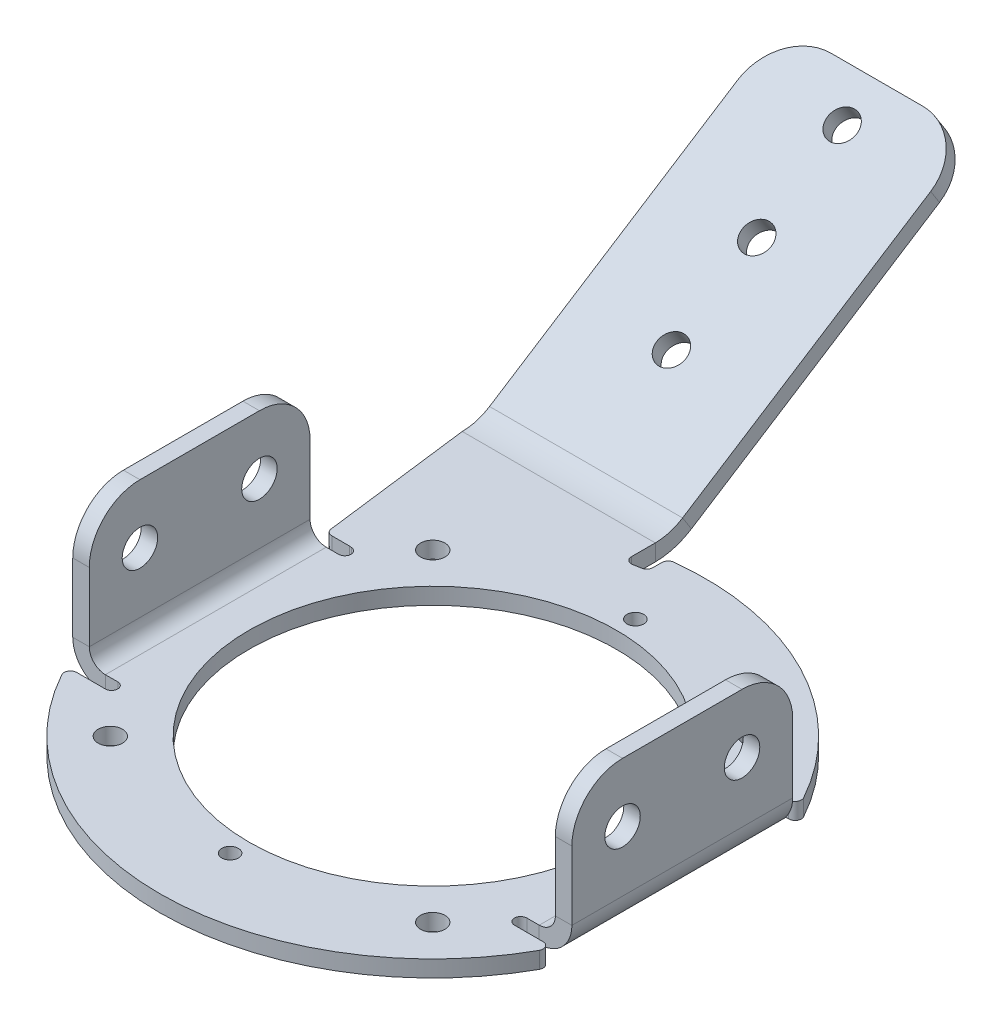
ISO-10303-21;
HEADER;
FILE_DESCRIPTION(('STEP AP214'),'2;1');
FILE_NAME('part.step','',(''),(''),'','','');
FILE_SCHEMA(('AUTOMOTIVE_DESIGN { 1 0 10303 214 1 1 1 1 }'));
ENDSEC;
DATA;
#1=APPLICATION_CONTEXT('core data for automotive mechanical design processes');
#2=APPLICATION_PROTOCOL_DEFINITION('international standard','automotive_design',2000,#1);
#3=PRODUCT_CONTEXT('',#1,'mechanical');
#4=PRODUCT('Part','Part','',(#3));
#5=PRODUCT_RELATED_PRODUCT_CATEGORY('part','',(#4));
#6=PRODUCT_DEFINITION_FORMATION('','',#4);
#7=PRODUCT_DEFINITION_CONTEXT('part definition',#1,'design');
#8=PRODUCT_DEFINITION('design','',#6,#7);
#9=PRODUCT_DEFINITION_SHAPE('','',#8);
#10=(LENGTH_UNIT() NAMED_UNIT(*) SI_UNIT(.MILLI.,.METRE.));
#11=(NAMED_UNIT(*) PLANE_ANGLE_UNIT() SI_UNIT($,.RADIAN.));
#12=(NAMED_UNIT(*) SI_UNIT($,.STERADIAN.) SOLID_ANGLE_UNIT());
#13=UNCERTAINTY_MEASURE_WITH_UNIT(LENGTH_MEASURE(1.E-05),#10,'distance_accuracy_value','');
#14=(GEOMETRIC_REPRESENTATION_CONTEXT(3) GLOBAL_UNCERTAINTY_ASSIGNED_CONTEXT((#13)) GLOBAL_UNIT_ASSIGNED_CONTEXT((#10,
#11,#12)) REPRESENTATION_CONTEXT('',''));
#15=CARTESIAN_POINT('',(0.,0.,0.));
#16=DIRECTION('',(0.,0.,1.));
#17=DIRECTION('',(1.,0.,0.));
#18=AXIS2_PLACEMENT_3D('',#15,#16,#17);
#19=CARTESIAN_POINT('',(98.35,3.17499999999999,0.));
#20=DIRECTION('',(0.,1.,0.));
#21=DIRECTION('',(0.,0.,1.));
#22=AXIS2_PLACEMENT_3D('',#19,#20,#21);
#23=PLANE('',#22);
#24=CARTESIAN_POINT('',(130.169805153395,3.17499999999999,-31.8198051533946));
#25=DIRECTION('',(0.,-1.,0.));
#26=DIRECTION('',(0.,0.,1.));
#27=AXIS2_PLACEMENT_3D('',#24,#25,#26);
#28=CIRCLE('',#27,2.4);
#29=CARTESIAN_POINT('',(130.169805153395,3.17499999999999,-29.4198051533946));
#30=VERTEX_POINT('',#29);
#31=EDGE_CURVE('E1057',#30,#30,#28,.T.);
#32=ORIENTED_EDGE('',*,*,#31,.T.);
#33=EDGE_LOOP('',(#32));
#34=FACE_BOUND('',#33,.T.);
#35=CARTESIAN_POINT('',(130.169805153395,3.17499999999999,31.8198051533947));
#36=DIRECTION('',(0.,-1.,0.));
#37=DIRECTION('',(0.,0.,1.));
#38=AXIS2_PLACEMENT_3D('',#35,#36,#37);
#39=CIRCLE('',#38,2.4);
#40=CARTESIAN_POINT('',(130.169805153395,3.17499999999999,34.2198051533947));
#41=VERTEX_POINT('',#40);
#42=EDGE_CURVE('E1061',#41,#41,#39,.T.);
#43=ORIENTED_EDGE('',*,*,#42,.T.);
#44=EDGE_LOOP('',(#43));
#45=FACE_BOUND('',#44,.T.);
#46=CARTESIAN_POINT('',(66.5301948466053,3.175,31.8198051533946));
#47=DIRECTION('',(0.,-1.,0.));
#48=DIRECTION('',(0.,0.,1.));
#49=AXIS2_PLACEMENT_3D('',#46,#47,#48);
#50=CIRCLE('',#49,2.4);
#51=CARTESIAN_POINT('',(66.5301948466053,3.175,34.2198051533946));
#52=VERTEX_POINT('',#51);
#53=EDGE_CURVE('E1065',#52,#52,#50,.T.);
#54=ORIENTED_EDGE('',*,*,#53,.T.);
#55=EDGE_LOOP('',(#54));
#56=FACE_BOUND('',#55,.T.);
#57=CARTESIAN_POINT('',(98.35,3.17499999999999,40.));
#58=DIRECTION('',(0.,-1.,0.));
#59=DIRECTION('',(0.,0.,1.));
#60=AXIS2_PLACEMENT_3D('',#57,#58,#59);
#61=CIRCLE('',#60,1.65);
#62=CARTESIAN_POINT('',(98.35,3.17499999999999,41.65));
#63=VERTEX_POINT('',#62);
#64=EDGE_CURVE('E1069',#63,#63,#61,.T.);
#65=ORIENTED_EDGE('',*,*,#64,.T.);
#66=EDGE_LOOP('',(#65));
#67=FACE_BOUND('',#66,.T.);
#68=CARTESIAN_POINT('',(66.5301948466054,3.175,-31.8198051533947));
#69=DIRECTION('',(0.,-1.,0.));
#70=DIRECTION('',(0.,0.,1.));
#71=AXIS2_PLACEMENT_3D('',#68,#69,#70);
#72=CIRCLE('',#71,2.4);
#73=CARTESIAN_POINT('',(66.5301948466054,3.175,-29.4198051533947));
#74=VERTEX_POINT('',#73);
#75=EDGE_CURVE('E1073',#74,#74,#72,.T.);
#76=ORIENTED_EDGE('',*,*,#75,.T.);
#77=EDGE_LOOP('',(#76));
#78=FACE_BOUND('',#77,.T.);
#79=CARTESIAN_POINT('',(98.35,3.17499999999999,-40.));
#80=DIRECTION('',(0.,-1.,0.));
#81=DIRECTION('',(0.,0.,1.));
#82=AXIS2_PLACEMENT_3D('',#79,#80,#81);
#83=CIRCLE('',#82,1.65);
#84=CARTESIAN_POINT('',(98.35,3.17499999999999,-38.35));
#85=VERTEX_POINT('',#84);
#86=EDGE_CURVE('E1077',#85,#85,#83,.T.);
#87=ORIENTED_EDGE('',*,*,#86,.T.);
#88=EDGE_LOOP('',(#87));
#89=FACE_BOUND('',#88,.T.);
#90=CARTESIAN_POINT('',(98.35,3.17499999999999,0.));
#91=DIRECTION('',(0.,-1.,0.));
#92=DIRECTION('',(0.,0.,1.));
#93=AXIS2_PLACEMENT_3D('',#90,#91,#92);
#94=CIRCLE('',#93,36.25);
#95=CARTESIAN_POINT('',(98.35,3.17499999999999,36.25));
#96=VERTEX_POINT('',#95);
#97=EDGE_CURVE('E1081',#96,#96,#94,.T.);
#98=ORIENTED_EDGE('',*,*,#97,.T.);
#99=EDGE_LOOP('',(#98));
#100=FACE_BOUND('',#99,.T.);
#101=DIRECTION('',(-1.,0.,0.));
#102=VECTOR('',#101,1.);
#103=CARTESIAN_POINT('',(98.35,3.17499999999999,-24.2944947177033));
#104=LINE('',#103,#102);
#105=CARTESIAN_POINT('',(57.6592818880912,3.175,-24.2944947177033));
#106=VERTEX_POINT('',#105);
#107=CARTESIAN_POINT('',(54.1383460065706,3.175,-24.2944947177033));
#108=VERTEX_POINT('',#107);
#109=EDGE_CURVE('E480',#106,#108,#104,.T.);
#110=ORIENTED_EDGE('',*,*,#109,.F.);
#111=CARTESIAN_POINT('',(57.6592818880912,3.175,-23.0444947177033));
#112=DIRECTION('',(0.,-1.,0.));
#113=DIRECTION('',(0.,0.,1.));
#114=AXIS2_PLACEMENT_3D('',#111,#112,#113);
#115=CIRCLE('',#114,1.25);
#116=CARTESIAN_POINT('',(58.03,3.17499999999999,-24.2382568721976));
#117=VERTEX_POINT('',#116);
#118=EDGE_CURVE('E492',#117,#106,#115,.F.);
#119=ORIENTED_EDGE('',*,*,#118,.F.);
#120=CARTESIAN_POINT('',(57.975,3.17499999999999,-23.0169947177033));
#121=DIRECTION('',(0.,-1.,0.));
#122=DIRECTION('',(0.,0.,1.));
#123=AXIS2_PLACEMENT_3D('',#120,#121,#122);
#124=CIRCLE('',#123,1.2225);
#125=CARTESIAN_POINT('',(57.975,3.175,-21.7944947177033));
#126=VERTEX_POINT('',#125);
#127=EDGE_CURVE('E475',#117,#126,#124,.T.);
#128=ORIENTED_EDGE('',*,*,#127,.T.);
#129=DIRECTION('',(-1.,0.,0.));
#130=VECTOR('',#129,1.);
#131=CARTESIAN_POINT('',(57.975,3.17499999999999,-21.7944947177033));
#132=LINE('',#131,#130);
#133=CARTESIAN_POINT('',(55.5299999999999,3.175,-21.7944947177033));
#134=VERTEX_POINT('',#133);
#135=EDGE_CURVE('E1018',#126,#134,#132,.T.);
#136=ORIENTED_EDGE('',*,*,#135,.T.);
#137=DIRECTION('',(0.,0.,-1.));
#138=VECTOR('',#137,1.);
#139=CARTESIAN_POINT('',(55.5299999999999,3.17499999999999,-21.7944947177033));
#140=LINE('',#139,#138);
#141=CARTESIAN_POINT('',(55.5299999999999,3.175,21.7944947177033));
#142=VERTEX_POINT('',#141);
#143=EDGE_CURVE('E961',#134,#142,#140,.F.);
#144=ORIENTED_EDGE('',*,*,#143,.T.);
#145=DIRECTION('',(1.,0.,0.));
#146=VECTOR('',#145,1.);
#147=CARTESIAN_POINT('',(55.5299999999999,3.17499999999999,21.7944947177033));
#148=LINE('',#147,#146);
#149=CARTESIAN_POINT('',(57.9749999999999,3.175,21.7944947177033));
#150=VERTEX_POINT('',#149);
#151=EDGE_CURVE('E1023',#142,#150,#148,.T.);
#152=ORIENTED_EDGE('',*,*,#151,.T.);
#153=CARTESIAN_POINT('',(57.9749999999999,3.17499999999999,23.0169947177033));
#154=DIRECTION('',(0.,-1.,0.));
#155=DIRECTION('',(0.,0.,1.));
#156=AXIS2_PLACEMENT_3D('',#153,#154,#155);
#157=CIRCLE('',#156,1.2225);
#158=CARTESIAN_POINT('',(57.9749999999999,3.175,24.2394947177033));
#159=VERTEX_POINT('',#158);
#160=EDGE_CURVE('E1027',#150,#159,#157,.T.);
#161=ORIENTED_EDGE('',*,*,#160,.T.);
#162=DIRECTION('',(-1.,0.,0.));
#163=VECTOR('',#162,1.);
#164=CARTESIAN_POINT('',(57.9749999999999,3.17499999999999,24.2394947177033));
#165=LINE('',#164,#163);
#166=CARTESIAN_POINT('',(52.3203278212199,3.175,24.2394947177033));
#167=VERTEX_POINT('',#166);
#168=EDGE_CURVE('E1032',#159,#167,#165,.T.);
#169=ORIENTED_EDGE('',*,*,#168,.T.);
#170=CARTESIAN_POINT('',(52.3203278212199,3.175,25.4894947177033));
#171=DIRECTION('',(0.,-1.,0.));
#172=DIRECTION('',(0.,0.,1.));
#173=AXIS2_PLACEMENT_3D('',#170,#171,#172);
#174=CIRCLE('',#173,1.25);
#175=CARTESIAN_POINT('',(51.2267997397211,3.175,26.0950492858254));
#176=VERTEX_POINT('',#175);
#177=EDGE_CURVE('E623',#176,#167,#174,.T.);
#178=ORIENTED_EDGE('',*,*,#177,.F.);
#179=CARTESIAN_POINT('',(98.35,3.17499999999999,0.));
#180=DIRECTION('',(0.,-1.,0.));
#181=DIRECTION('',(0.,0.,1.));
#182=AXIS2_PLACEMENT_3D('',#179,#180,#181);
#183=CIRCLE('',#182,53.8660152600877);
#184=CARTESIAN_POINT('',(145.473200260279,3.17499999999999,26.0950492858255));
#185=VERTEX_POINT('',#184);
#186=EDGE_CURVE('E766',#176,#185,#183,.F.);
#187=ORIENTED_EDGE('',*,*,#186,.T.);
#188=CARTESIAN_POINT('',(144.37967217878,3.17499999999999,25.4894947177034));
#189=DIRECTION('',(0.,-1.,0.));
#190=DIRECTION('',(0.,0.,1.));
#191=AXIS2_PLACEMENT_3D('',#188,#189,#190);
#192=CIRCLE('',#191,1.25);
#193=CARTESIAN_POINT('',(144.37967217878,3.17499999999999,24.2394947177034));
#194=VERTEX_POINT('',#193);
#195=EDGE_CURVE('E619',#194,#185,#192,.T.);
#196=ORIENTED_EDGE('',*,*,#195,.F.);
#197=DIRECTION('',(-1.,0.,0.));
#198=VECTOR('',#197,1.);
#199=CARTESIAN_POINT('',(142.081532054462,3.17499999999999,24.2394947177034));
#200=LINE('',#199,#198);
#201=CARTESIAN_POINT('',(138.725,3.17499999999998,24.2394947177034));
#202=VERTEX_POINT('',#201);
#203=EDGE_CURVE('E975',#194,#202,#200,.T.);
#204=ORIENTED_EDGE('',*,*,#203,.T.);
#205=CARTESIAN_POINT('',(138.725,3.17499999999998,23.0169947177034));
#206=DIRECTION('',(0.,-1.,0.));
#207=DIRECTION('',(0.,0.,1.));
#208=AXIS2_PLACEMENT_3D('',#205,#206,#207);
#209=CIRCLE('',#208,1.2225);
#210=CARTESIAN_POINT('',(138.725,3.17499999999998,21.7944947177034));
#211=VERTEX_POINT('',#210);
#212=EDGE_CURVE('E980',#202,#211,#209,.T.);
#213=ORIENTED_EDGE('',*,*,#212,.T.);
#214=DIRECTION('',(1.,0.,0.));
#215=VECTOR('',#214,1.);
#216=CARTESIAN_POINT('',(138.725,3.17499999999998,21.7944947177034));
#217=LINE('',#216,#215);
#218=CARTESIAN_POINT('',(141.17,3.17499999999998,21.7944947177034));
#219=VERTEX_POINT('',#218);
#220=EDGE_CURVE('E985',#211,#219,#217,.T.);
#221=ORIENTED_EDGE('',*,*,#220,.T.);
#222=DIRECTION('',(0.,0.,1.));
#223=VECTOR('',#222,1.);
#224=CARTESIAN_POINT('',(141.17,3.17499999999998,21.7944947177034));
#225=LINE('',#224,#223);
#226=CARTESIAN_POINT('',(141.17,3.17499999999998,-21.7944947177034));
#227=VERTEX_POINT('',#226);
#228=EDGE_CURVE('E893',#219,#227,#225,.F.);
#229=ORIENTED_EDGE('',*,*,#228,.T.);
#230=DIRECTION('',(-1.,0.,0.));
#231=VECTOR('',#230,1.);
#232=CARTESIAN_POINT('',(141.17,3.17499999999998,-21.7944947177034));
#233=LINE('',#232,#231);
#234=CARTESIAN_POINT('',(138.725,3.17499999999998,-21.7944947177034));
#235=VERTEX_POINT('',#234);
#236=EDGE_CURVE('E990',#227,#235,#233,.T.);
#237=ORIENTED_EDGE('',*,*,#236,.T.);
#238=CARTESIAN_POINT('',(138.725,3.17499999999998,-23.0169947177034));
#239=DIRECTION('',(0.,-1.,0.));
#240=DIRECTION('',(0.,0.,1.));
#241=AXIS2_PLACEMENT_3D('',#238,#239,#240);
#242=CIRCLE('',#241,1.2225);
#243=CARTESIAN_POINT('',(138.725,3.17499999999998,-24.2394947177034));
#244=VERTEX_POINT('',#243);
#245=EDGE_CURVE('E994',#235,#244,#242,.T.);
#246=ORIENTED_EDGE('',*,*,#245,.T.);
#247=DIRECTION('',(1.,0.,0.));
#248=VECTOR('',#247,1.);
#249=CARTESIAN_POINT('',(138.725,3.17499999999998,-24.2394947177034));
#250=LINE('',#249,#248);
#251=CARTESIAN_POINT('',(144.37967217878,3.17499999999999,-24.2394947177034));
#252=VERTEX_POINT('',#251);
#253=EDGE_CURVE('E999',#244,#252,#250,.T.);
#254=ORIENTED_EDGE('',*,*,#253,.T.);
#255=CARTESIAN_POINT('',(144.37967217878,3.17499999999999,-25.4894947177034));
#256=DIRECTION('',(0.,-1.,0.));
#257=DIRECTION('',(0.,0.,1.));
#258=AXIS2_PLACEMENT_3D('',#255,#256,#257);
#259=CIRCLE('',#258,1.25);
#260=CARTESIAN_POINT('',(145.473200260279,3.17499999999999,-26.0950492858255));
#261=VERTEX_POINT('',#260);
#262=EDGE_CURVE('E615',#261,#252,#259,.T.);
#263=ORIENTED_EDGE('',*,*,#262,.F.);
#264=CARTESIAN_POINT('',(98.35,3.17499999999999,0.));
#265=DIRECTION('',(0.,-1.,0.));
#266=DIRECTION('',(0.,0.,1.));
#267=AXIS2_PLACEMENT_3D('',#264,#265,#266);
#268=CIRCLE('',#267,53.8660152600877);
#269=CARTESIAN_POINT('',(92.3866153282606,3.17499999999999,-53.5349011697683));
#270=VERTEX_POINT('',#269);
#271=EDGE_CURVE('E775',#261,#270,#268,.F.);
#272=ORIENTED_EDGE('',*,*,#271,.T.);
#273=CARTESIAN_POINT('',(92.525,3.17499999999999,-52.2925849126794));
#274=DIRECTION('',(0.,-1.,0.));
#275=DIRECTION('',(0.,0.,1.));
#276=AXIS2_PLACEMENT_3D('',#273,#274,#275);
#277=CIRCLE('',#276,1.25);
#278=CARTESIAN_POINT('',(91.275,3.17499999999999,-52.2925849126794));
#279=VERTEX_POINT('',#278);
#280=EDGE_CURVE('E627',#279,#270,#277,.T.);
#281=ORIENTED_EDGE('',*,*,#280,.F.);
#282=DIRECTION('',(0.,0.,1.));
#283=VECTOR('',#282,1.);
#284=CARTESIAN_POINT('',(91.275,3.17499999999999,0.));
#285=LINE('',#284,#283);
#286=CARTESIAN_POINT('',(91.275,3.17499999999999,-50.5693274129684));
#287=VERTEX_POINT('',#286);
#288=EDGE_CURVE('E779',#279,#287,#285,.T.);
#289=ORIENTED_EDGE('',*,*,#288,.T.);
#290=CARTESIAN_POINT('',(90.025,3.175,-50.5693274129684));
#291=DIRECTION('',(0.,-1.,0.));
#292=DIRECTION('',(0.,0.,1.));
#293=AXIS2_PLACEMENT_3D('',#290,#291,#292);
#294=CIRCLE('',#293,1.25);
#295=CARTESIAN_POINT('',(90.2280487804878,3.175,-49.3359291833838));
#296=VERTEX_POINT('',#295);
#297=EDGE_CURVE('E13',#296,#287,#294,.F.);
#298=ORIENTED_EDGE('',*,*,#297,.F.);
#299=CARTESIAN_POINT('',(98.35,3.17499999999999,0.));
#300=DIRECTION('',(0.,-1.,0.));
#301=DIRECTION('',(0.,0.,1.));
#302=AXIS2_PLACEMENT_3D('',#299,#300,#301);
#303=CIRCLE('',#302,50.);
#304=CARTESIAN_POINT('',(88.7646341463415,3.175,-49.0726070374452));
#305=VERTEX_POINT('',#304);
#306=EDGE_CURVE('E1045',#305,#296,#303,.T.);
#307=ORIENTED_EDGE('',*,*,#306,.F.);
#308=CARTESIAN_POINT('',(88.525,3.175,-50.2994222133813));
#309=DIRECTION('',(0.,-1.,0.));
#310=DIRECTION('',(0.,0.,1.));
#311=AXIS2_PLACEMENT_3D('',#308,#309,#310);
#312=CIRCLE('',#311,1.25);
#313=CARTESIAN_POINT('',(87.275,3.175,-50.2994222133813));
#314=VERTEX_POINT('',#313);
#315=EDGE_CURVE('E491',#314,#305,#312,.F.);
#316=ORIENTED_EDGE('',*,*,#315,.F.);
#317=DIRECTION('',(0.,0.,1.));
#318=VECTOR('',#317,1.);
#319=CARTESIAN_POINT('',(87.275,3.175,0.));
#320=LINE('',#319,#318);
#321=CARTESIAN_POINT('',(87.275,3.175,-55.));
#322=VERTEX_POINT('',#321);
#323=EDGE_CURVE('E1042',#322,#314,#320,.T.);
#324=ORIENTED_EDGE('',*,*,#323,.F.);
#325=DIRECTION('',(-1.,0.,0.));
#326=VECTOR('',#325,1.);
#327=CARTESIAN_POINT('',(98.35,3.17499999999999,-55.));
#328=LINE('',#327,#326);
#329=CARTESIAN_POINT('',(49.175,3.175,-55.));
#330=VERTEX_POINT('',#329);
#331=EDGE_CURVE('E1053',#322,#330,#328,.T.);
#332=ORIENTED_EDGE('',*,*,#331,.T.);
#333=DIRECTION('',(-0.124749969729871,0.,-0.992188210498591));
#334=VECTOR('',#333,1.);
#335=CARTESIAN_POINT('',(56.7479383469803,3.175,5.23071719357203));
#336=LINE('',#335,#334);
#337=CARTESIAN_POINT('',(52.8981107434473,3.175,-25.388557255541));
#338=VERTEX_POINT('',#337);
#339=EDGE_CURVE('E1049',#338,#330,#336,.T.);
#340=ORIENTED_EDGE('',*,*,#339,.F.);
#341=CARTESIAN_POINT('',(54.1383460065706,3.175,-25.5444947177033));
#342=DIRECTION('',(0.,-1.,0.));
#343=DIRECTION('',(0.,0.,1.));
#344=AXIS2_PLACEMENT_3D('',#341,#342,#343);
#345=CIRCLE('',#344,1.25);
#346=EDGE_CURVE('E631',#108,#338,#345,.T.);
#347=ORIENTED_EDGE('',*,*,#346,.F.);
#348=EDGE_LOOP('',(#110,#119,#128,#136,#144,#152,#161,#169,#178,#187,#196,#204,#213,#221,#229,
#237,#246,#254,#263,#272,#281,#289,#298,#307,#316,#324,#332,#340,#347));
#349=FACE_BOUND('',#348,.T.);
#350=ADVANCED_FACE('F164',(#34,#45,#56,#67,#78,#89,#100,#349),#23,.T.);
#351=CARTESIAN_POINT('',(98.35,-0.0850000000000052,0.));
#352=DIRECTION('',(0.,1.,0.));
#353=DIRECTION('',(0.,0.,1.));
#354=AXIS2_PLACEMENT_3D('',#351,#352,#353);
#355=PLANE('',#354);
#356=CARTESIAN_POINT('',(98.35,-0.0850000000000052,0.));
#357=DIRECTION('',(0.,-1.,0.));
#358=DIRECTION('',(0.,0.,1.));
#359=AXIS2_PLACEMENT_3D('',#356,#357,#358);
#360=CIRCLE('',#359,36.25);
#361=CARTESIAN_POINT('',(98.35,-0.0850000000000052,36.25));
#362=VERTEX_POINT('',#361);
#363=EDGE_CURVE('E1046',#362,#362,#360,.T.);
#364=ORIENTED_EDGE('',*,*,#363,.F.);
#365=EDGE_LOOP('',(#364));
#366=FACE_BOUND('',#365,.T.);
#367=CARTESIAN_POINT('',(98.35,-0.0850000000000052,-40.));
#368=DIRECTION('',(0.,-1.,0.));
#369=DIRECTION('',(0.,0.,1.));
#370=AXIS2_PLACEMENT_3D('',#367,#368,#369);
#371=CIRCLE('',#370,1.65);
#372=CARTESIAN_POINT('',(98.35,-0.0850000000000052,-38.35));
#373=VERTEX_POINT('',#372);
#374=EDGE_CURVE('E1120',#373,#373,#371,.T.);
#375=ORIENTED_EDGE('',*,*,#374,.F.);
#376=EDGE_LOOP('',(#375));
#377=FACE_BOUND('',#376,.T.);
#378=CARTESIAN_POINT('',(66.5301948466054,-0.0850000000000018,-31.8198051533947));
#379=DIRECTION('',(0.,-1.,0.));
#380=DIRECTION('',(0.,0.,1.));
#381=AXIS2_PLACEMENT_3D('',#378,#379,#380);
#382=CIRCLE('',#381,2.4);
#383=CARTESIAN_POINT('',(66.5301948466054,-0.0850000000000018,-29.4198051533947));
#384=VERTEX_POINT('',#383);
#385=EDGE_CURVE('E1116',#384,#384,#382,.T.);
#386=ORIENTED_EDGE('',*,*,#385,.F.);
#387=EDGE_LOOP('',(#386));
#388=FACE_BOUND('',#387,.T.);
#389=CARTESIAN_POINT('',(98.35,-0.0850000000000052,40.));
#390=DIRECTION('',(0.,-1.,0.));
#391=DIRECTION('',(0.,0.,1.));
#392=AXIS2_PLACEMENT_3D('',#389,#390,#391);
#393=CIRCLE('',#392,1.65);
#394=CARTESIAN_POINT('',(98.35,-0.0850000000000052,41.65));
#395=VERTEX_POINT('',#394);
#396=EDGE_CURVE('E1112',#395,#395,#393,.T.);
#397=ORIENTED_EDGE('',*,*,#396,.F.);
#398=EDGE_LOOP('',(#397));
#399=FACE_BOUND('',#398,.T.);
#400=CARTESIAN_POINT('',(66.5301948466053,-0.0850000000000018,31.8198051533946));
#401=DIRECTION('',(0.,-1.,0.));
#402=DIRECTION('',(0.,0.,1.));
#403=AXIS2_PLACEMENT_3D('',#400,#401,#402);
#404=CIRCLE('',#403,2.4);
#405=CARTESIAN_POINT('',(66.5301948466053,-0.0850000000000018,34.2198051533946));
#406=VERTEX_POINT('',#405);
#407=EDGE_CURVE('E1108',#406,#406,#404,.T.);
#408=ORIENTED_EDGE('',*,*,#407,.F.);
#409=EDGE_LOOP('',(#408));
#410=FACE_BOUND('',#409,.T.);
#411=CARTESIAN_POINT('',(130.169805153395,-0.0850000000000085,31.8198051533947));
#412=DIRECTION('',(0.,-1.,0.));
#413=DIRECTION('',(0.,0.,1.));
#414=AXIS2_PLACEMENT_3D('',#411,#412,#413);
#415=CIRCLE('',#414,2.4);
#416=CARTESIAN_POINT('',(130.169805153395,-0.0850000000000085,34.2198051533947));
#417=VERTEX_POINT('',#416);
#418=EDGE_CURVE('E1104',#417,#417,#415,.T.);
#419=ORIENTED_EDGE('',*,*,#418,.F.);
#420=EDGE_LOOP('',(#419));
#421=FACE_BOUND('',#420,.T.);
#422=CARTESIAN_POINT('',(130.169805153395,-0.0850000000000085,-31.8198051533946));
#423=DIRECTION('',(0.,-1.,0.));
#424=DIRECTION('',(0.,0.,1.));
#425=AXIS2_PLACEMENT_3D('',#422,#423,#424);
#426=CIRCLE('',#425,2.4);
#427=CARTESIAN_POINT('',(130.169805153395,-0.0850000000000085,-29.4198051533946));
#428=VERTEX_POINT('',#427);
#429=EDGE_CURVE('E1094',#428,#428,#426,.T.);
#430=ORIENTED_EDGE('',*,*,#429,.F.);
#431=EDGE_LOOP('',(#430));
#432=FACE_BOUND('',#431,.T.);
#433=DIRECTION('',(-0.124749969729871,0.,-0.992188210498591));
#434=VECTOR('',#433,1.);
#435=CARTESIAN_POINT('',(56.7479383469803,-0.0850000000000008,5.23071719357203));
#436=LINE('',#435,#434);
#437=CARTESIAN_POINT('',(52.8981107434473,-0.0850000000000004,-25.388557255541));
#438=VERTEX_POINT('',#437);
#439=CARTESIAN_POINT('',(49.175,-0.085,-55.));
#440=VERTEX_POINT('',#439);
#441=EDGE_CURVE('E1095',#438,#440,#436,.T.);
#442=ORIENTED_EDGE('',*,*,#441,.T.);
#443=DIRECTION('',(-1.,0.,0.));
#444=VECTOR('',#443,1.);
#445=CARTESIAN_POINT('',(98.35,-0.0850000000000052,-55.));
#446=LINE('',#445,#444);
#447=CARTESIAN_POINT('',(87.275,-0.085000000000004,-55.));
#448=VERTEX_POINT('',#447);
#449=EDGE_CURVE('E1090',#448,#440,#446,.T.);
#450=ORIENTED_EDGE('',*,*,#449,.F.);
#451=DIRECTION('',(0.,0.,1.));
#452=VECTOR('',#451,1.);
#453=CARTESIAN_POINT('',(87.275,-0.085000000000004,0.));
#454=LINE('',#453,#452);
#455=CARTESIAN_POINT('',(87.275,-0.085000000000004,-50.2994222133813));
#456=VERTEX_POINT('',#455);
#457=EDGE_CURVE('E1017',#448,#456,#454,.T.);
#458=ORIENTED_EDGE('',*,*,#457,.T.);
#459=CARTESIAN_POINT('',(88.525,-0.0850000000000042,-50.2994222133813));
#460=DIRECTION('',(0.,-1.,0.));
#461=DIRECTION('',(0.,0.,1.));
#462=AXIS2_PLACEMENT_3D('',#459,#460,#461);
#463=CIRCLE('',#462,1.25);
#464=CARTESIAN_POINT('',(88.7646341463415,-0.0850000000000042,-49.0726070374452));
#465=VERTEX_POINT('',#464);
#466=EDGE_CURVE('E697',#465,#456,#463,.T.);
#467=ORIENTED_EDGE('',*,*,#466,.F.);
#468=CARTESIAN_POINT('',(98.35,-0.0850000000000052,0.));
#469=DIRECTION('',(0.,-1.,0.));
#470=DIRECTION('',(0.,0.,1.));
#471=AXIS2_PLACEMENT_3D('',#468,#469,#470);
#472=CIRCLE('',#471,50.);
#473=CARTESIAN_POINT('',(90.2280487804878,-0.0850000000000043,-49.3359291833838));
#474=VERTEX_POINT('',#473);
#475=EDGE_CURVE('E1089',#465,#474,#472,.T.);
#476=ORIENTED_EDGE('',*,*,#475,.T.);
#477=CARTESIAN_POINT('',(90.025,-0.0850000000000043,-50.5693274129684));
#478=DIRECTION('',(0.,-1.,0.));
#479=DIRECTION('',(0.,0.,1.));
#480=AXIS2_PLACEMENT_3D('',#477,#478,#479);
#481=CIRCLE('',#480,1.25);
#482=CARTESIAN_POINT('',(91.275,-0.0850000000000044,-50.5693274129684));
#483=VERTEX_POINT('',#482);
#484=EDGE_CURVE('E174',#483,#474,#481,.T.);
#485=ORIENTED_EDGE('',*,*,#484,.F.);
#486=DIRECTION('',(0.,0.,1.));
#487=VECTOR('',#486,1.);
#488=CARTESIAN_POINT('',(91.275,-0.0850000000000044,0.));
#489=LINE('',#488,#487);
#490=CARTESIAN_POINT('',(91.275,-0.0850000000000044,-52.2925849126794));
#491=VERTEX_POINT('',#490);
#492=EDGE_CURVE('E771',#491,#483,#489,.T.);
#493=ORIENTED_EDGE('',*,*,#492,.F.);
#494=CARTESIAN_POINT('',(92.525,-0.0850000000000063,-52.2925849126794));
#495=DIRECTION('',(0.,-1.,0.));
#496=DIRECTION('',(0.,0.,1.));
#497=AXIS2_PLACEMENT_3D('',#494,#495,#496);
#498=CIRCLE('',#497,1.25);
#499=CARTESIAN_POINT('',(92.3866153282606,-0.0850000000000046,-53.5349011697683));
#500=VERTEX_POINT('',#499);
#501=EDGE_CURVE('E650',#500,#491,#498,.F.);
#502=ORIENTED_EDGE('',*,*,#501,.F.);
#503=CARTESIAN_POINT('',(98.35,-0.0850000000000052,0.));
#504=DIRECTION('',(0.,1.,0.));
#505=DIRECTION('',(0.,0.,-1.));
#506=AXIS2_PLACEMENT_3D('',#503,#504,#505);
#507=CIRCLE('',#506,53.8660152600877);
#508=CARTESIAN_POINT('',(145.473200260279,-0.0850000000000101,-26.0950492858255));
#509=VERTEX_POINT('',#508);
#510=EDGE_CURVE('E770',#509,#500,#507,.T.);
#511=ORIENTED_EDGE('',*,*,#510,.F.);
#512=CARTESIAN_POINT('',(144.37967217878,-0.0850000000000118,-25.4894947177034));
#513=DIRECTION('',(0.,-1.,0.));
#514=DIRECTION('',(0.,0.,1.));
#515=AXIS2_PLACEMENT_3D('',#512,#513,#514);
#516=CIRCLE('',#515,1.25);
#517=CARTESIAN_POINT('',(144.37967217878,-0.08500000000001,-24.2394947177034));
#518=VERTEX_POINT('',#517);
#519=EDGE_CURVE('E638',#518,#509,#516,.F.);
#520=ORIENTED_EDGE('',*,*,#519,.F.);
#521=DIRECTION('',(-1.,0.,0.));
#522=VECTOR('',#521,1.);
#523=CARTESIAN_POINT('',(98.35,-0.0850000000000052,-24.2394947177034));
#524=LINE('',#523,#522);
#525=CARTESIAN_POINT('',(138.725,-0.0850000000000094,-24.2394947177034));
#526=VERTEX_POINT('',#525);
#527=EDGE_CURVE('E979',#518,#526,#524,.T.);
#528=ORIENTED_EDGE('',*,*,#527,.T.);
#529=CARTESIAN_POINT('',(138.725,-0.0850000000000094,-23.0169947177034));
#530=DIRECTION('',(0.,-1.,0.));
#531=DIRECTION('',(0.,0.,1.));
#532=AXIS2_PLACEMENT_3D('',#529,#530,#531);
#533=CIRCLE('',#532,1.2225);
#534=CARTESIAN_POINT('',(138.725,-0.0850000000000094,-21.7944947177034));
#535=VERTEX_POINT('',#534);
#536=EDGE_CURVE('E500',#526,#535,#533,.F.);
#537=ORIENTED_EDGE('',*,*,#536,.T.);
#538=DIRECTION('',(1.,0.,0.));
#539=VECTOR('',#538,1.);
#540=CARTESIAN_POINT('',(98.35,-0.0850000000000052,-21.7944947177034));
#541=LINE('',#540,#539);
#542=CARTESIAN_POINT('',(141.17,-0.0850000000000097,-21.7944947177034));
#543=VERTEX_POINT('',#542);
#544=EDGE_CURVE('E505',#535,#543,#541,.T.);
#545=ORIENTED_EDGE('',*,*,#544,.T.);
#546=DIRECTION('',(0.,0.,1.));
#547=VECTOR('',#546,1.);
#548=CARTESIAN_POINT('',(141.17,-0.0850000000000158,21.7944947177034));
#549=LINE('',#548,#547);
#550=CARTESIAN_POINT('',(141.17,-0.0850000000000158,21.7944947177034));
#551=VERTEX_POINT('',#550);
#552=EDGE_CURVE('E877',#551,#543,#549,.F.);
#553=ORIENTED_EDGE('',*,*,#552,.F.);
#554=DIRECTION('',(-1.,0.,0.));
#555=VECTOR('',#554,1.);
#556=CARTESIAN_POINT('',(98.35,-0.0850000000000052,21.7944947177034));
#557=LINE('',#556,#555);
#558=CARTESIAN_POINT('',(138.725,-0.0850000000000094,21.7944947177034));
#559=VERTEX_POINT('',#558);
#560=EDGE_CURVE('E514',#551,#559,#557,.T.);
#561=ORIENTED_EDGE('',*,*,#560,.T.);
#562=CARTESIAN_POINT('',(138.725,-0.0850000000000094,23.0169947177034));
#563=DIRECTION('',(0.,-1.,0.));
#564=DIRECTION('',(0.,0.,1.));
#565=AXIS2_PLACEMENT_3D('',#562,#563,#564);
#566=CIRCLE('',#565,1.2225);
#567=CARTESIAN_POINT('',(138.725,-0.0850000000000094,24.2394947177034));
#568=VERTEX_POINT('',#567);
#569=EDGE_CURVE('E518',#559,#568,#566,.F.);
#570=ORIENTED_EDGE('',*,*,#569,.T.);
#571=DIRECTION('',(1.,0.,0.));
#572=VECTOR('',#571,1.);
#573=CARTESIAN_POINT('',(98.35,-0.0850000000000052,24.2394947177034));
#574=LINE('',#573,#572);
#575=CARTESIAN_POINT('',(144.37967217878,-0.08500000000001,24.2394947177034));
#576=VERTEX_POINT('',#575);
#577=EDGE_CURVE('E522',#568,#576,#574,.T.);
#578=ORIENTED_EDGE('',*,*,#577,.T.);
#579=CARTESIAN_POINT('',(144.37967217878,-0.0850000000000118,25.4894947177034));
#580=DIRECTION('',(0.,-1.,0.));
#581=DIRECTION('',(0.,0.,1.));
#582=AXIS2_PLACEMENT_3D('',#579,#580,#581);
#583=CIRCLE('',#582,1.25);
#584=CARTESIAN_POINT('',(145.473200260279,-0.0850000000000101,26.0950492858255));
#585=VERTEX_POINT('',#584);
#586=EDGE_CURVE('E642',#585,#576,#583,.F.);
#587=ORIENTED_EDGE('',*,*,#586,.F.);
#588=CARTESIAN_POINT('',(98.35,-0.0850000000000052,0.));
#589=DIRECTION('',(0.,1.,0.));
#590=DIRECTION('',(0.,0.,-1.));
#591=AXIS2_PLACEMENT_3D('',#588,#589,#590);
#592=CIRCLE('',#591,53.8660152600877);
#593=CARTESIAN_POINT('',(51.2267997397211,-0.0850000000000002,26.0950492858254));
#594=VERTEX_POINT('',#593);
#595=EDGE_CURVE('E762',#594,#585,#592,.T.);
#596=ORIENTED_EDGE('',*,*,#595,.F.);
#597=CARTESIAN_POINT('',(52.3203278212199,-0.0850000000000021,25.4894947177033));
#598=DIRECTION('',(0.,-1.,0.));
#599=DIRECTION('',(0.,0.,1.));
#600=AXIS2_PLACEMENT_3D('',#597,#598,#599);
#601=CIRCLE('',#600,1.25);
#602=CARTESIAN_POINT('',(52.3203278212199,-0.0850000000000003,24.2394947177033));
#603=VERTEX_POINT('',#602);
#604=EDGE_CURVE('E646',#603,#594,#601,.F.);
#605=ORIENTED_EDGE('',*,*,#604,.F.);
#606=DIRECTION('',(1.,0.,0.));
#607=VECTOR('',#606,1.);
#608=CARTESIAN_POINT('',(98.35,-0.0850000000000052,24.2394947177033));
#609=LINE('',#608,#607);
#610=CARTESIAN_POINT('',(57.9749999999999,-0.0850000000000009,24.2394947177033));
#611=VERTEX_POINT('',#610);
#612=EDGE_CURVE('E1134',#603,#611,#609,.T.);
#613=ORIENTED_EDGE('',*,*,#612,.T.);
#614=CARTESIAN_POINT('',(57.9749999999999,-0.0850000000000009,23.0169947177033));
#615=DIRECTION('',(0.,-1.,0.));
#616=DIRECTION('',(0.,0.,1.));
#617=AXIS2_PLACEMENT_3D('',#614,#615,#616);
#618=CIRCLE('',#617,1.2225);
#619=CARTESIAN_POINT('',(57.9749999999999,-0.0850000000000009,21.7944947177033));
#620=VERTEX_POINT('',#619);
#621=EDGE_CURVE('E1138',#611,#620,#618,.F.);
#622=ORIENTED_EDGE('',*,*,#621,.T.);
#623=DIRECTION('',(-1.,0.,0.));
#624=VECTOR('',#623,1.);
#625=CARTESIAN_POINT('',(98.35,-0.0850000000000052,21.7944947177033));
#626=LINE('',#625,#624);
#627=CARTESIAN_POINT('',(55.5299999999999,-0.0850000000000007,21.7944947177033));
#628=VERTEX_POINT('',#627);
#629=EDGE_CURVE('E507',#620,#628,#626,.T.);
#630=ORIENTED_EDGE('',*,*,#629,.T.);
#631=DIRECTION('',(0.,0.,-1.));
#632=VECTOR('',#631,1.);
#633=CARTESIAN_POINT('',(55.5299999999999,-0.0850000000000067,-21.7944947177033));
#634=LINE('',#633,#632);
#635=CARTESIAN_POINT('',(55.5299999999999,-0.0850000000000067,-21.7944947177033));
#636=VERTEX_POINT('',#635);
#637=EDGE_CURVE('E945',#636,#628,#634,.F.);
#638=ORIENTED_EDGE('',*,*,#637,.F.);
#639=DIRECTION('',(1.,0.,0.));
#640=VECTOR('',#639,1.);
#641=CARTESIAN_POINT('',(98.35,-0.0850000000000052,-21.7944947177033));
#642=LINE('',#641,#640);
#643=CARTESIAN_POINT('',(57.975,-0.0850000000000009,-21.7944947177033));
#644=VERTEX_POINT('',#643);
#645=EDGE_CURVE('E498',#636,#644,#642,.T.);
#646=ORIENTED_EDGE('',*,*,#645,.T.);
#647=CARTESIAN_POINT('',(57.975,-0.0850000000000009,-23.0169947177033));
#648=DIRECTION('',(0.,-1.,0.));
#649=DIRECTION('',(0.,0.,1.));
#650=AXIS2_PLACEMENT_3D('',#647,#648,#649);
#651=CIRCLE('',#650,1.2225);
#652=CARTESIAN_POINT('',(58.03,-0.085000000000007,-24.2382568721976));
#653=VERTEX_POINT('',#652);
#654=EDGE_CURVE('E472',#644,#653,#651,.F.);
#655=ORIENTED_EDGE('',*,*,#654,.T.);
#656=CARTESIAN_POINT('',(57.6592818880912,-0.0850000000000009,-23.0444947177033));
#657=DIRECTION('',(0.,-1.,0.));
#658=DIRECTION('',(0.,0.,1.));
#659=AXIS2_PLACEMENT_3D('',#656,#657,#658);
#660=CIRCLE('',#659,1.25);
#661=CARTESIAN_POINT('',(57.6592818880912,-0.085000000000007,-24.2944947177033));
#662=VERTEX_POINT('',#661);
#663=EDGE_CURVE('E484',#662,#653,#660,.T.);
#664=ORIENTED_EDGE('',*,*,#663,.F.);
#665=DIRECTION('',(-1.,0.,0.));
#666=VECTOR('',#665,1.);
#667=CARTESIAN_POINT('',(98.35,-0.0850000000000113,-24.2944947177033));
#668=LINE('',#667,#666);
#669=CARTESIAN_POINT('',(54.1383460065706,-0.0850000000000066,-24.2944947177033));
#670=VERTEX_POINT('',#669);
#671=EDGE_CURVE('E481',#662,#670,#668,.T.);
#672=ORIENTED_EDGE('',*,*,#671,.T.);
#673=CARTESIAN_POINT('',(54.1383460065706,-0.0850000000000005,-25.5444947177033));
#674=DIRECTION('',(0.,-1.,0.));
#675=DIRECTION('',(0.,0.,1.));
#676=AXIS2_PLACEMENT_3D('',#673,#674,#675);
#677=CIRCLE('',#676,1.25);
#678=EDGE_CURVE('E654',#438,#670,#677,.F.);
#679=ORIENTED_EDGE('',*,*,#678,.F.);
#680=EDGE_LOOP('',(#442,#450,#458,#467,#476,#485,#493,#502,#511,#520,#528,#537,#545,#553,#561,
#570,#578,#587,#596,#605,#613,#622,#630,#638,#646,#655,#664,#672,#679));
#681=FACE_BOUND('',#680,.T.);
#682=ADVANCED_FACE('F495',(#366,#377,#388,#399,#410,#421,#432,#681),#355,.F.);
#683=CARTESIAN_POINT('',(56.7479383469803,3.175,5.23071719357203));
#684=DIRECTION('',(-0.992188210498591,0.,0.124749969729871));
#685=DIRECTION('',(-0.124749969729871,0.,-0.992188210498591));
#686=AXIS2_PLACEMENT_3D('',#683,#684,#685);
#687=PLANE('',#686);
#688=ORIENTED_EDGE('',*,*,#339,.T.);
#689=DIRECTION('',(0.,1.,0.));
#690=VECTOR('',#689,1.);
#691=CARTESIAN_POINT('',(49.175,3.175,-55.));
#692=LINE('',#691,#690);
#693=EDGE_CURVE('E1130',#440,#330,#692,.T.);
#694=ORIENTED_EDGE('',*,*,#693,.F.);
#695=ORIENTED_EDGE('',*,*,#441,.F.);
#696=DIRECTION('',(0.,1.,0.));
#697=VECTOR('',#696,1.);
#698=CARTESIAN_POINT('',(52.8981107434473,3.175,-25.388557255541));
#699=LINE('',#698,#697);
#700=EDGE_CURVE('E635',#338,#438,#699,.F.);
#701=ORIENTED_EDGE('',*,*,#700,.F.);
#702=EDGE_LOOP('',(#688,#694,#695,#701));
#703=FACE_BOUND('',#702,.T.);
#704=ADVANCED_FACE('F1176',(#703),#687,.T.);
#705=CARTESIAN_POINT('',(57.975,3.17499999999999,-23.0169947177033));
#706=DIRECTION('',(0.,-1.,0.));
#707=DIRECTION('',(0.,0.,-1.));
#708=AXIS2_PLACEMENT_3D('',#705,#706,#707);
#709=CYLINDRICAL_SURFACE('',#708,1.2225);
#710=ORIENTED_EDGE('',*,*,#654,.F.);
#711=DIRECTION('',(0.,-1.,0.));
#712=VECTOR('',#711,1.);
#713=CARTESIAN_POINT('',(57.975,3.17499999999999,-21.7944947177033));
#714=LINE('',#713,#712);
#715=EDGE_CURVE('E1022',#126,#644,#714,.T.);
#716=ORIENTED_EDGE('',*,*,#715,.F.);
#717=ORIENTED_EDGE('',*,*,#127,.F.);
#718=DIRECTION('',(0.,1.,0.));
#719=VECTOR('',#718,1.);
#720=CARTESIAN_POINT('',(58.03,-0.085000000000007,-24.2382568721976));
#721=LINE('',#720,#719);
#722=EDGE_CURVE('E468',#653,#117,#721,.T.);
#723=ORIENTED_EDGE('',*,*,#722,.F.);
#724=EDGE_LOOP('',(#710,#716,#717,#723));
#725=FACE_BOUND('',#724,.T.);
#726=ADVANCED_FACE('F470',(#725),#709,.F.);
#727=CARTESIAN_POINT('',(98.35,3.17499999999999,0.));
#728=DIRECTION('',(0.,1.,0.));
#729=DIRECTION('',(0.,0.,1.));
#730=AXIS2_PLACEMENT_3D('',#727,#728,#729);
#731=CYLINDRICAL_SURFACE('',#730,50.);
#732=ORIENTED_EDGE('',*,*,#306,.T.);
#733=DIRECTION('',(0.,1.,0.));
#734=VECTOR('',#733,1.);
#735=CARTESIAN_POINT('',(90.2280487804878,3.175,-49.3359291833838));
#736=LINE('',#735,#734);
#737=EDGE_CURVE('E190',#474,#296,#736,.T.);
#738=ORIENTED_EDGE('',*,*,#737,.F.);
#739=ORIENTED_EDGE('',*,*,#475,.F.);
#740=DIRECTION('',(0.,1.,0.));
#741=VECTOR('',#740,1.);
#742=CARTESIAN_POINT('',(88.7646341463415,3.175,-49.0726070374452));
#743=LINE('',#742,#741);
#744=EDGE_CURVE('E662',#305,#465,#743,.F.);
#745=ORIENTED_EDGE('',*,*,#744,.F.);
#746=EDGE_LOOP('',(#732,#738,#739,#745));
#747=FACE_BOUND('',#746,.T.);
#748=ADVANCED_FACE('F1197',(#747),#731,.T.);
#749=CARTESIAN_POINT('',(87.275,3.175,0.));
#750=DIRECTION('',(1.,0.,0.));
#751=DIRECTION('',(0.,0.,1.));
#752=AXIS2_PLACEMENT_3D('',#749,#750,#751);
#753=PLANE('',#752);
#754=ORIENTED_EDGE('',*,*,#457,.F.);
#755=DIRECTION('',(0.,1.,0.));
#756=VECTOR('',#755,1.);
#757=CARTESIAN_POINT('',(87.275,3.175,-55.));
#758=LINE('',#757,#756);
#759=EDGE_CURVE('E1085',#448,#322,#758,.T.);
#760=ORIENTED_EDGE('',*,*,#759,.T.);
#761=ORIENTED_EDGE('',*,*,#323,.T.);
#762=DIRECTION('',(0.,-1.,0.));
#763=VECTOR('',#762,1.);
#764=CARTESIAN_POINT('',(87.275,3.175,-50.2994222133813));
#765=LINE('',#764,#763);
#766=EDGE_CURVE('E182',#456,#314,#765,.F.);
#767=ORIENTED_EDGE('',*,*,#766,.F.);
#768=EDGE_LOOP('',(#754,#760,#761,#767));
#769=FACE_BOUND('',#768,.T.);
#770=ADVANCED_FACE('F1184',(#769),#753,.T.);
#771=CARTESIAN_POINT('',(130.169805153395,3.17499999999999,-31.8198051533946));
#772=DIRECTION('',(0.,1.,0.));
#773=DIRECTION('',(0.,0.,1.));
#774=AXIS2_PLACEMENT_3D('',#771,#772,#773);
#775=CYLINDRICAL_SURFACE('',#774,2.4);
#776=ORIENTED_EDGE('',*,*,#31,.F.);
#777=EDGE_LOOP('',(#776));
#778=FACE_BOUND('',#777,.T.);
#779=ORIENTED_EDGE('',*,*,#429,.T.);
#780=EDGE_LOOP('',(#779));
#781=FACE_BOUND('',#780,.T.);
#782=ADVANCED_FACE('F1321',(#778,#781),#775,.F.);
#783=CARTESIAN_POINT('',(130.169805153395,3.17499999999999,31.8198051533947));
#784=DIRECTION('',(0.,1.,0.));
#785=DIRECTION('',(0.,0.,1.));
#786=AXIS2_PLACEMENT_3D('',#783,#784,#785);
#787=CYLINDRICAL_SURFACE('',#786,2.4);
#788=ORIENTED_EDGE('',*,*,#42,.F.);
#789=EDGE_LOOP('',(#788));
#790=FACE_BOUND('',#789,.T.);
#791=ORIENTED_EDGE('',*,*,#418,.T.);
#792=EDGE_LOOP('',(#791));
#793=FACE_BOUND('',#792,.T.);
#794=ADVANCED_FACE('F1328',(#790,#793),#787,.F.);
#795=CARTESIAN_POINT('',(66.5301948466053,3.175,31.8198051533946));
#796=DIRECTION('',(0.,1.,0.));
#797=DIRECTION('',(0.,0.,1.));
#798=AXIS2_PLACEMENT_3D('',#795,#796,#797);
#799=CYLINDRICAL_SURFACE('',#798,2.4);
#800=ORIENTED_EDGE('',*,*,#53,.F.);
#801=EDGE_LOOP('',(#800));
#802=FACE_BOUND('',#801,.T.);
#803=ORIENTED_EDGE('',*,*,#407,.T.);
#804=EDGE_LOOP('',(#803));
#805=FACE_BOUND('',#804,.T.);
#806=ADVANCED_FACE('F1332',(#802,#805),#799,.F.);
#807=CARTESIAN_POINT('',(98.35,3.17499999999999,40.));
#808=DIRECTION('',(0.,1.,0.));
#809=DIRECTION('',(0.,0.,1.));
#810=AXIS2_PLACEMENT_3D('',#807,#808,#809);
#811=CYLINDRICAL_SURFACE('',#810,1.65);
#812=ORIENTED_EDGE('',*,*,#64,.F.);
#813=EDGE_LOOP('',(#812));
#814=FACE_BOUND('',#813,.T.);
#815=ORIENTED_EDGE('',*,*,#396,.T.);
#816=EDGE_LOOP('',(#815));
#817=FACE_BOUND('',#816,.T.);
#818=ADVANCED_FACE('F1336',(#814,#817),#811,.F.);
#819=CARTESIAN_POINT('',(66.5301948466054,3.175,-31.8198051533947));
#820=DIRECTION('',(0.,1.,0.));
#821=DIRECTION('',(0.,0.,1.));
#822=AXIS2_PLACEMENT_3D('',#819,#820,#821);
#823=CYLINDRICAL_SURFACE('',#822,2.4);
#824=ORIENTED_EDGE('',*,*,#75,.F.);
#825=EDGE_LOOP('',(#824));
#826=FACE_BOUND('',#825,.T.);
#827=ORIENTED_EDGE('',*,*,#385,.T.);
#828=EDGE_LOOP('',(#827));
#829=FACE_BOUND('',#828,.T.);
#830=ADVANCED_FACE('F1340',(#826,#829),#823,.F.);
#831=CARTESIAN_POINT('',(98.35,3.17499999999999,-40.));
#832=DIRECTION('',(0.,1.,0.));
#833=DIRECTION('',(0.,0.,1.));
#834=AXIS2_PLACEMENT_3D('',#831,#832,#833);
#835=CYLINDRICAL_SURFACE('',#834,1.65);
#836=ORIENTED_EDGE('',*,*,#86,.F.);
#837=EDGE_LOOP('',(#836));
#838=FACE_BOUND('',#837,.T.);
#839=ORIENTED_EDGE('',*,*,#374,.T.);
#840=EDGE_LOOP('',(#839));
#841=FACE_BOUND('',#840,.T.);
#842=ADVANCED_FACE('F1344',(#838,#841),#835,.F.);
#843=CARTESIAN_POINT('',(98.35,3.17499999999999,0.));
#844=DIRECTION('',(0.,1.,0.));
#845=DIRECTION('',(0.,0.,1.));
#846=AXIS2_PLACEMENT_3D('',#843,#844,#845);
#847=CYLINDRICAL_SURFACE('',#846,36.25);
#848=ORIENTED_EDGE('',*,*,#97,.F.);
#849=EDGE_LOOP('',(#848));
#850=FACE_BOUND('',#849,.T.);
#851=ORIENTED_EDGE('',*,*,#363,.T.);
#852=EDGE_LOOP('',(#851));
#853=FACE_BOUND('',#852,.T.);
#854=ADVANCED_FACE('F1347',(#850,#853),#847,.F.);
#855=CARTESIAN_POINT('',(57.975,3.17499999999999,-21.7944947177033));
#856=DIRECTION('',(0.,0.,-1.));
#857=DIRECTION('',(0.,1.,0.));
#858=AXIS2_PLACEMENT_3D('',#855,#856,#857);
#859=PLANE('',#858);
#860=DIRECTION('',(0.,-1.,0.));
#861=VECTOR('',#860,1.);
#862=CARTESIAN_POINT('',(55.5299999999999,3.17499999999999,-21.7944947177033));
#863=LINE('',#862,#861);
#864=EDGE_CURVE('E954',#134,#636,#863,.T.);
#865=ORIENTED_EDGE('',*,*,#864,.F.);
#866=ORIENTED_EDGE('',*,*,#135,.F.);
#867=ORIENTED_EDGE('',*,*,#715,.T.);
#868=ORIENTED_EDGE('',*,*,#645,.F.);
#869=EDGE_LOOP('',(#865,#866,#867,#868));
#870=FACE_BOUND('',#869,.T.);
#871=ADVANCED_FACE('F1163',(#870),#859,.T.);
#872=CARTESIAN_POINT('',(55.5299999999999,3.17499999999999,21.7944947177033));
#873=DIRECTION('',(0.,0.,1.));
#874=DIRECTION('',(0.,-1.,0.));
#875=AXIS2_PLACEMENT_3D('',#872,#873,#874);
#876=PLANE('',#875);
#877=DIRECTION('',(0.,-1.,0.));
#878=VECTOR('',#877,1.);
#879=CARTESIAN_POINT('',(57.9749999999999,3.17499999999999,21.7944947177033));
#880=LINE('',#879,#878);
#881=EDGE_CURVE('E1031',#150,#620,#880,.T.);
#882=ORIENTED_EDGE('',*,*,#881,.F.);
#883=ORIENTED_EDGE('',*,*,#151,.F.);
#884=DIRECTION('',(0.,-1.,0.));
#885=VECTOR('',#884,1.);
#886=CARTESIAN_POINT('',(55.5299999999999,3.17499999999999,21.7944947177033));
#887=LINE('',#886,#885);
#888=EDGE_CURVE('E967',#142,#628,#887,.T.);
#889=ORIENTED_EDGE('',*,*,#888,.T.);
#890=ORIENTED_EDGE('',*,*,#629,.F.);
#891=EDGE_LOOP('',(#882,#883,#889,#890));
#892=FACE_BOUND('',#891,.T.);
#893=ADVANCED_FACE('F1146',(#892),#876,.T.);
#894=CARTESIAN_POINT('',(57.9749999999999,3.17499999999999,23.0169947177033));
#895=DIRECTION('',(0.,-1.,0.));
#896=DIRECTION('',(0.,0.,-1.));
#897=AXIS2_PLACEMENT_3D('',#894,#895,#896);
#898=CYLINDRICAL_SURFACE('',#897,1.2225);
#899=DIRECTION('',(0.,-1.,0.));
#900=VECTOR('',#899,1.);
#901=CARTESIAN_POINT('',(57.9749999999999,3.17499999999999,24.2394947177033));
#902=LINE('',#901,#900);
#903=EDGE_CURVE('E1014',#159,#611,#902,.T.);
#904=ORIENTED_EDGE('',*,*,#903,.F.);
#905=ORIENTED_EDGE('',*,*,#160,.F.);
#906=ORIENTED_EDGE('',*,*,#881,.T.);
#907=ORIENTED_EDGE('',*,*,#621,.F.);
#908=EDGE_LOOP('',(#904,#905,#906,#907));
#909=FACE_BOUND('',#908,.T.);
#910=ADVANCED_FACE('F1266',(#909),#898,.F.);
#911=CARTESIAN_POINT('',(57.9749999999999,3.17499999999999,24.2394947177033));
#912=DIRECTION('',(0.,0.,-1.));
#913=DIRECTION('',(0.,1.,0.));
#914=AXIS2_PLACEMENT_3D('',#911,#912,#913);
#915=PLANE('',#914);
#916=ORIENTED_EDGE('',*,*,#168,.F.);
#917=ORIENTED_EDGE('',*,*,#903,.T.);
#918=ORIENTED_EDGE('',*,*,#612,.F.);
#919=DIRECTION('',(0.,-1.,0.));
#920=VECTOR('',#919,1.);
#921=CARTESIAN_POINT('',(52.3203278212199,3.17499999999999,24.2394947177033));
#922=LINE('',#921,#920);
#923=EDGE_CURVE('E677',#167,#603,#922,.T.);
#924=ORIENTED_EDGE('',*,*,#923,.F.);
#925=EDGE_LOOP('',(#916,#917,#918,#924));
#926=FACE_BOUND('',#925,.T.);
#927=ADVANCED_FACE('F1264',(#926),#915,.T.);
#928=CARTESIAN_POINT('',(142.081532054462,3.17499999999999,24.2394947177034));
#929=DIRECTION('',(0.,0.,-1.));
#930=DIRECTION('',(0.,1.,0.));
#931=AXIS2_PLACEMENT_3D('',#928,#929,#930);
#932=PLANE('',#931);
#933=ORIENTED_EDGE('',*,*,#577,.F.);
#934=DIRECTION('',(0.,-1.,0.));
#935=VECTOR('',#934,1.);
#936=CARTESIAN_POINT('',(138.725,3.17499999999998,24.2394947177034));
#937=LINE('',#936,#935);
#938=EDGE_CURVE('E984',#202,#568,#937,.T.);
#939=ORIENTED_EDGE('',*,*,#938,.F.);
#940=ORIENTED_EDGE('',*,*,#203,.F.);
#941=DIRECTION('',(0.,-1.,0.));
#942=VECTOR('',#941,1.);
#943=CARTESIAN_POINT('',(144.37967217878,3.17499999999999,24.2394947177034));
#944=LINE('',#943,#942);
#945=EDGE_CURVE('E686',#576,#194,#944,.F.);
#946=ORIENTED_EDGE('',*,*,#945,.F.);
#947=EDGE_LOOP('',(#933,#939,#940,#946));
#948=FACE_BOUND('',#947,.T.);
#949=ADVANCED_FACE('F1248',(#948),#932,.T.);
#950=CARTESIAN_POINT('',(138.725,3.17499999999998,23.0169947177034));
#951=DIRECTION('',(0.,-1.,0.));
#952=DIRECTION('',(0.,0.,-1.));
#953=AXIS2_PLACEMENT_3D('',#950,#951,#952);
#954=CYLINDRICAL_SURFACE('',#953,1.2225);
#955=DIRECTION('',(0.,-1.,0.));
#956=VECTOR('',#955,1.);
#957=CARTESIAN_POINT('',(138.725,3.17499999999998,21.7944947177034));
#958=LINE('',#957,#956);
#959=EDGE_CURVE('E989',#211,#559,#958,.T.);
#960=ORIENTED_EDGE('',*,*,#959,.F.);
#961=ORIENTED_EDGE('',*,*,#212,.F.);
#962=ORIENTED_EDGE('',*,*,#938,.T.);
#963=ORIENTED_EDGE('',*,*,#569,.F.);
#964=EDGE_LOOP('',(#960,#961,#962,#963));
#965=FACE_BOUND('',#964,.T.);
#966=ADVANCED_FACE('F1244',(#965),#954,.F.);
#967=CARTESIAN_POINT('',(138.725,3.17499999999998,21.7944947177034));
#968=DIRECTION('',(0.,0.,1.));
#969=DIRECTION('',(0.,-1.,0.));
#970=AXIS2_PLACEMENT_3D('',#967,#968,#969);
#971=PLANE('',#970);
#972=DIRECTION('',(0.,-1.,0.));
#973=VECTOR('',#972,1.);
#974=CARTESIAN_POINT('',(141.17,3.17499999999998,21.7944947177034));
#975=LINE('',#974,#973);
#976=EDGE_CURVE('E886',#219,#551,#975,.T.);
#977=ORIENTED_EDGE('',*,*,#976,.F.);
#978=ORIENTED_EDGE('',*,*,#220,.F.);
#979=ORIENTED_EDGE('',*,*,#959,.T.);
#980=ORIENTED_EDGE('',*,*,#560,.F.);
#981=EDGE_LOOP('',(#977,#978,#979,#980));
#982=FACE_BOUND('',#981,.T.);
#983=ADVANCED_FACE('F1239',(#982),#971,.T.);
#984=CARTESIAN_POINT('',(141.17,3.17499999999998,-21.7944947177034));
#985=DIRECTION('',(0.,0.,-1.));
#986=DIRECTION('',(0.,1.,0.));
#987=AXIS2_PLACEMENT_3D('',#984,#985,#986);
#988=PLANE('',#987);
#989=DIRECTION('',(0.,-1.,0.));
#990=VECTOR('',#989,1.);
#991=CARTESIAN_POINT('',(138.725,3.17499999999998,-21.7944947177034));
#992=LINE('',#991,#990);
#993=EDGE_CURVE('E998',#235,#535,#992,.T.);
#994=ORIENTED_EDGE('',*,*,#993,.F.);
#995=ORIENTED_EDGE('',*,*,#236,.F.);
#996=DIRECTION('',(0.,-1.,0.));
#997=VECTOR('',#996,1.);
#998=CARTESIAN_POINT('',(141.17,3.17499999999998,-21.7944947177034));
#999=LINE('',#998,#997);
#1000=EDGE_CURVE('E899',#227,#543,#999,.T.);
#1001=ORIENTED_EDGE('',*,*,#1000,.T.);
#1002=ORIENTED_EDGE('',*,*,#544,.F.);
#1003=EDGE_LOOP('',(#994,#995,#1001,#1002));
#1004=FACE_BOUND('',#1003,.T.);
#1005=ADVANCED_FACE('F1228',(#1004),#988,.T.);
#1006=CARTESIAN_POINT('',(138.725,3.17499999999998,-23.0169947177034));
#1007=DIRECTION('',(0.,-1.,0.));
#1008=DIRECTION('',(0.,0.,-1.));
#1009=AXIS2_PLACEMENT_3D('',#1006,#1007,#1008);
#1010=CYLINDRICAL_SURFACE('',#1009,1.2225);
#1011=DIRECTION('',(0.,-1.,0.));
#1012=VECTOR('',#1011,1.);
#1013=CARTESIAN_POINT('',(138.725,3.17499999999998,-24.2394947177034));
#1014=LINE('',#1013,#1012);
#1015=EDGE_CURVE('E971',#244,#526,#1014,.T.);
#1016=ORIENTED_EDGE('',*,*,#1015,.F.);
#1017=ORIENTED_EDGE('',*,*,#245,.F.);
#1018=ORIENTED_EDGE('',*,*,#993,.T.);
#1019=ORIENTED_EDGE('',*,*,#536,.F.);
#1020=EDGE_LOOP('',(#1016,#1017,#1018,#1019));
#1021=FACE_BOUND('',#1020,.T.);
#1022=ADVANCED_FACE('F1224',(#1021),#1010,.F.);
#1023=CARTESIAN_POINT('',(138.725,3.17499999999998,-24.2394947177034));
#1024=DIRECTION('',(0.,0.,1.));
#1025=DIRECTION('',(0.,-1.,0.));
#1026=AXIS2_PLACEMENT_3D('',#1023,#1024,#1025);
#1027=PLANE('',#1026);
#1028=ORIENTED_EDGE('',*,*,#253,.F.);
#1029=ORIENTED_EDGE('',*,*,#1015,.T.);
#1030=ORIENTED_EDGE('',*,*,#527,.F.);
#1031=DIRECTION('',(0.,-1.,0.));
#1032=VECTOR('',#1031,1.);
#1033=CARTESIAN_POINT('',(144.37967217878,3.17499999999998,-24.2394947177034));
#1034=LINE('',#1033,#1032);
#1035=EDGE_CURVE('E689',#252,#518,#1034,.T.);
#1036=ORIENTED_EDGE('',*,*,#1035,.F.);
#1037=EDGE_LOOP('',(#1028,#1029,#1030,#1036));
#1038=FACE_BOUND('',#1037,.T.);
#1039=ADVANCED_FACE('F1219',(#1038),#1027,.T.);
#1040=CARTESIAN_POINT('',(55.5299999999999,6.355,21.7944947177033));
#1041=DIRECTION('',(0.,0.,1.));
#1042=DIRECTION('',(-1.,0.,0.));
#1043=AXIS2_PLACEMENT_3D('',#1040,#1041,#1042);
#1044=PLANE('',#1043);
#1045=DIRECTION('',(1.,0.,0.));
#1046=VECTOR('',#1045,1.);
#1047=CARTESIAN_POINT('',(49.0899999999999,6.35499999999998,21.7944947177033));
#1048=LINE('',#1047,#1046);
#1049=CARTESIAN_POINT('',(52.3499999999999,6.35499999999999,21.7944947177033));
#1050=VERTEX_POINT('',#1049);
#1051=CARTESIAN_POINT('',(49.0899999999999,6.35499999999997,21.7944947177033));
#1052=VERTEX_POINT('',#1051);
#1053=EDGE_CURVE('E903',#1050,#1052,#1048,.F.);
#1054=ORIENTED_EDGE('',*,*,#1053,.T.);
#1055=CARTESIAN_POINT('',(55.5299999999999,6.355,21.7944947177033));
#1056=DIRECTION('',(0.,0.,1.));
#1057=DIRECTION('',(1.,0.,0.));
#1058=AXIS2_PLACEMENT_3D('',#1055,#1056,#1057);
#1059=CIRCLE('',#1058,6.44);
#1060=EDGE_CURVE('E949',#628,#1052,#1059,.F.);
#1061=ORIENTED_EDGE('',*,*,#1060,.F.);
#1062=ORIENTED_EDGE('',*,*,#888,.F.);
#1063=CARTESIAN_POINT('',(55.5299999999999,6.355,21.7944947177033));
#1064=DIRECTION('',(0.,0.,1.));
#1065=DIRECTION('',(1.,0.,0.));
#1066=AXIS2_PLACEMENT_3D('',#1063,#1064,#1065);
#1067=CIRCLE('',#1066,3.18);
#1068=EDGE_CURVE('E957',#142,#1050,#1067,.F.);
#1069=ORIENTED_EDGE('',*,*,#1068,.T.);
#1070=EDGE_LOOP('',(#1054,#1061,#1062,#1069));
#1071=FACE_BOUND('',#1070,.T.);
#1072=ADVANCED_FACE('F1271',(#1071),#1044,.T.);
#1073=CARTESIAN_POINT('',(55.5299999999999,6.355,-21.7944947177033));
#1074=DIRECTION('',(0.,0.,1.));
#1075=DIRECTION('',(-1.,0.,0.));
#1076=AXIS2_PLACEMENT_3D('',#1073,#1074,#1075);
#1077=PLANE('',#1076);
#1078=CARTESIAN_POINT('',(55.5299999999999,6.355,-21.7944947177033));
#1079=DIRECTION('',(0.,0.,1.));
#1080=DIRECTION('',(1.,0.,0.));
#1081=AXIS2_PLACEMENT_3D('',#1078,#1079,#1080);
#1082=CIRCLE('',#1081,3.18);
#1083=CARTESIAN_POINT('',(52.3499999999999,6.35499999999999,-21.7944947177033));
#1084=VERTEX_POINT('',#1083);
#1085=EDGE_CURVE('E910',#1084,#134,#1082,.T.);
#1086=ORIENTED_EDGE('',*,*,#1085,.T.);
#1087=ORIENTED_EDGE('',*,*,#864,.T.);
#1088=CARTESIAN_POINT('',(55.5299999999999,6.355,-21.7944947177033));
#1089=DIRECTION('',(0.,0.,1.));
#1090=DIRECTION('',(1.,0.,0.));
#1091=AXIS2_PLACEMENT_3D('',#1088,#1089,#1090);
#1092=CIRCLE('',#1091,6.44);
#1093=CARTESIAN_POINT('',(49.09,6.35499999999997,-21.7944947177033));
#1094=VERTEX_POINT('',#1093);
#1095=EDGE_CURVE('E950',#1094,#636,#1092,.T.);
#1096=ORIENTED_EDGE('',*,*,#1095,.F.);
#1097=DIRECTION('',(1.,0.,0.));
#1098=VECTOR('',#1097,1.);
#1099=CARTESIAN_POINT('',(52.35,6.35499999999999,-21.7944947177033));
#1100=LINE('',#1099,#1098);
#1101=EDGE_CURVE('E934',#1084,#1094,#1100,.F.);
#1102=ORIENTED_EDGE('',*,*,#1101,.F.);
#1103=EDGE_LOOP('',(#1086,#1087,#1096,#1102));
#1104=FACE_BOUND('',#1103,.T.);
#1105=ADVANCED_FACE('F1158',(#1104),#1077,.F.);
#1106=CARTESIAN_POINT('',(55.5299999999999,6.355,-21.7944947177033));
#1107=DIRECTION('',(0.,0.,-1.));
#1108=DIRECTION('',(-1.,0.,0.));
#1109=AXIS2_PLACEMENT_3D('',#1106,#1107,#1108);
#1110=CYLINDRICAL_SURFACE('',#1109,6.44);
#1111=ORIENTED_EDGE('',*,*,#637,.T.);
#1112=ORIENTED_EDGE('',*,*,#1060,.T.);
#1113=DIRECTION('',(0.,0.,-1.));
#1114=VECTOR('',#1113,1.);
#1115=CARTESIAN_POINT('',(49.0899999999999,6.35499999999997,21.7944947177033));
#1116=LINE('',#1115,#1114);
#1117=EDGE_CURVE('E930',#1094,#1052,#1116,.F.);
#1118=ORIENTED_EDGE('',*,*,#1117,.F.);
#1119=ORIENTED_EDGE('',*,*,#1095,.T.);
#1120=EDGE_LOOP('',(#1111,#1112,#1118,#1119));
#1121=FACE_BOUND('',#1120,.T.);
#1122=ADVANCED_FACE('F1152',(#1121),#1110,.T.);
#1123=CARTESIAN_POINT('',(55.5299999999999,6.355,-21.7944947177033));
#1124=DIRECTION('',(0.,0.,-1.));
#1125=DIRECTION('',(-1.,0.,0.));
#1126=AXIS2_PLACEMENT_3D('',#1123,#1124,#1125);
#1127=CYLINDRICAL_SURFACE('',#1126,3.18);
#1128=ORIENTED_EDGE('',*,*,#143,.F.);
#1129=ORIENTED_EDGE('',*,*,#1085,.F.);
#1130=DIRECTION('',(0.,0.,-1.));
#1131=VECTOR('',#1130,1.);
#1132=CARTESIAN_POINT('',(52.3499999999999,6.35499999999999,21.7944947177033));
#1133=LINE('',#1132,#1131);
#1134=EDGE_CURVE('E938',#1050,#1084,#1133,.T.);
#1135=ORIENTED_EDGE('',*,*,#1134,.F.);
#1136=ORIENTED_EDGE('',*,*,#1068,.F.);
#1137=EDGE_LOOP('',(#1128,#1129,#1135,#1136));
#1138=FACE_BOUND('',#1137,.T.);
#1139=ADVANCED_FACE('F1268',(#1138),#1127,.F.);
#1140=CARTESIAN_POINT('',(49.0899999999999,29.915,-21.7944947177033));
#1141=DIRECTION('',(0.,0.,1.));
#1142=DIRECTION('',(0.,-1.,0.));
#1143=AXIS2_PLACEMENT_3D('',#1140,#1141,#1142);
#1144=PLANE('',#1143);
#1145=DIRECTION('',(0.,-1.,0.));
#1146=VECTOR('',#1145,1.);
#1147=CARTESIAN_POINT('',(52.3499999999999,29.915,-21.7944947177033));
#1148=LINE('',#1147,#1146);
#1149=CARTESIAN_POINT('',(52.3499999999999,19.915,-21.7944947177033));
#1150=VERTEX_POINT('',#1149);
#1151=EDGE_CURVE('E926',#1084,#1150,#1148,.F.);
#1152=ORIENTED_EDGE('',*,*,#1151,.F.);
#1153=ORIENTED_EDGE('',*,*,#1101,.T.);
#1154=DIRECTION('',(0.,1.,0.));
#1155=VECTOR('',#1154,1.);
#1156=CARTESIAN_POINT('',(49.09,-1.66005586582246E-13,-21.7944947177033));
#1157=LINE('',#1156,#1155);
#1158=CARTESIAN_POINT('',(49.0899999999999,19.915,-21.7944947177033));
#1159=VERTEX_POINT('',#1158);
#1160=EDGE_CURVE('E915',#1094,#1159,#1157,.T.);
#1161=ORIENTED_EDGE('',*,*,#1160,.T.);
#1162=DIRECTION('',(1.,0.,0.));
#1163=VECTOR('',#1162,1.);
#1164=CARTESIAN_POINT('',(49.0899999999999,19.915,-21.7944947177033));
#1165=LINE('',#1164,#1163);
#1166=EDGE_CURVE('E539',#1150,#1159,#1165,.F.);
#1167=ORIENTED_EDGE('',*,*,#1166,.F.);
#1168=EDGE_LOOP('',(#1152,#1153,#1161,#1167));
#1169=FACE_BOUND('',#1168,.T.);
#1170=ADVANCED_FACE('F1283',(#1169),#1144,.F.);
#1171=CARTESIAN_POINT('',(49.0899999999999,3.17499999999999,21.7944947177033));
#1172=DIRECTION('',(0.,0.,-1.));
#1173=DIRECTION('',(1.,0.,0.));
#1174=AXIS2_PLACEMENT_3D('',#1171,#1172,#1173);
#1175=PLANE('',#1174);
#1176=DIRECTION('',(0.,-1.,0.));
#1177=VECTOR('',#1176,1.);
#1178=CARTESIAN_POINT('',(49.09,-1.63177806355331E-13,21.7944947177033));
#1179=LINE('',#1178,#1177);
#1180=CARTESIAN_POINT('',(49.0899999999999,19.915,21.7944947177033));
#1181=VERTEX_POINT('',#1180);
#1182=EDGE_CURVE('E907',#1181,#1052,#1179,.T.);
#1183=ORIENTED_EDGE('',*,*,#1182,.T.);
#1184=ORIENTED_EDGE('',*,*,#1053,.F.);
#1185=DIRECTION('',(0.,1.,0.));
#1186=VECTOR('',#1185,1.);
#1187=CARTESIAN_POINT('',(52.3499999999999,3.175,21.7944947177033));
#1188=LINE('',#1187,#1186);
#1189=CARTESIAN_POINT('',(52.3499999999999,19.915,21.7944947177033));
#1190=VERTEX_POINT('',#1189);
#1191=EDGE_CURVE('E919',#1190,#1050,#1188,.F.);
#1192=ORIENTED_EDGE('',*,*,#1191,.F.);
#1193=DIRECTION('',(1.,0.,0.));
#1194=VECTOR('',#1193,1.);
#1195=CARTESIAN_POINT('',(49.0899999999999,19.915,21.7944947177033));
#1196=LINE('',#1195,#1194);
#1197=EDGE_CURVE('E550',#1181,#1190,#1196,.T.);
#1198=ORIENTED_EDGE('',*,*,#1197,.F.);
#1199=EDGE_LOOP('',(#1183,#1184,#1192,#1198));
#1200=FACE_BOUND('',#1199,.T.);
#1201=ADVANCED_FACE('F1274',(#1200),#1175,.F.);
#1202=CARTESIAN_POINT('',(49.09,-1.63177806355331E-13,0.));
#1203=DIRECTION('',(1.,0.,0.));
#1204=DIRECTION('',(0.,-1.,0.));
#1205=AXIS2_PLACEMENT_3D('',#1202,#1203,#1204);
#1206=PLANE('',#1205);
#1207=CARTESIAN_POINT('',(49.0899999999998,18.2750000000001,-11.7944947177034));
#1208=DIRECTION('',(-1.,0.,0.));
#1209=DIRECTION('',(0.,-1.,0.));
#1210=AXIS2_PLACEMENT_3D('',#1207,#1208,#1209);
#1211=CIRCLE('',#1210,3.5);
#1212=CARTESIAN_POINT('',(49.0899999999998,14.7750000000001,-11.7944947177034));
#1213=VERTEX_POINT('',#1212);
#1214=EDGE_CURVE('E718',#1213,#1213,#1211,.T.);
#1215=ORIENTED_EDGE('',*,*,#1214,.F.);
#1216=EDGE_LOOP('',(#1215));
#1217=FACE_BOUND('',#1216,.T.);
#1218=CARTESIAN_POINT('',(49.0899999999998,18.2750000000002,11.7944947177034));
#1219=DIRECTION('',(-1.,0.,0.));
#1220=DIRECTION('',(0.,-1.,0.));
#1221=AXIS2_PLACEMENT_3D('',#1218,#1219,#1220);
#1222=CIRCLE('',#1221,3.5);
#1223=CARTESIAN_POINT('',(49.0899999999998,14.7750000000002,11.7944947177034));
#1224=VERTEX_POINT('',#1223);
#1225=EDGE_CURVE('E732',#1224,#1224,#1222,.T.);
#1226=ORIENTED_EDGE('',*,*,#1225,.F.);
#1227=EDGE_LOOP('',(#1226));
#1228=FACE_BOUND('',#1227,.T.);
#1229=ORIENTED_EDGE('',*,*,#1160,.F.);
#1230=ORIENTED_EDGE('',*,*,#1117,.T.);
#1231=ORIENTED_EDGE('',*,*,#1182,.F.);
#1232=CARTESIAN_POINT('',(49.0899999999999,19.915,11.7944947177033));
#1233=DIRECTION('',(-1.,0.,0.));
#1234=DIRECTION('',(0.,-1.,0.));
#1235=AXIS2_PLACEMENT_3D('',#1232,#1233,#1234);
#1236=CIRCLE('',#1235,10.);
#1237=CARTESIAN_POINT('',(49.0899999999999,29.915,11.7944947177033));
#1238=VERTEX_POINT('',#1237);
#1239=EDGE_CURVE('E543',#1238,#1181,#1236,.F.);
#1240=ORIENTED_EDGE('',*,*,#1239,.F.);
#1241=DIRECTION('',(0.,0.,1.));
#1242=VECTOR('',#1241,1.);
#1243=CARTESIAN_POINT('',(49.0899999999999,29.915,0.));
#1244=LINE('',#1243,#1242);
#1245=CARTESIAN_POINT('',(49.0899999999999,29.915,-11.7944947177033));
#1246=VERTEX_POINT('',#1245);
#1247=EDGE_CURVE('E911',#1246,#1238,#1244,.T.);
#1248=ORIENTED_EDGE('',*,*,#1247,.F.);
#1249=CARTESIAN_POINT('',(49.0899999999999,19.915,-11.7944947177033));
#1250=DIRECTION('',(-1.,0.,0.));
#1251=DIRECTION('',(0.,-1.,0.));
#1252=AXIS2_PLACEMENT_3D('',#1249,#1250,#1251);
#1253=CIRCLE('',#1252,10.);
#1254=EDGE_CURVE('E546',#1159,#1246,#1253,.F.);
#1255=ORIENTED_EDGE('',*,*,#1254,.F.);
#1256=EDGE_LOOP('',(#1229,#1230,#1231,#1240,#1248,#1255));
#1257=FACE_BOUND('',#1256,.T.);
#1258=ADVANCED_FACE('F1279',(#1217,#1228,#1257),#1206,.F.);
#1259=CARTESIAN_POINT('',(52.35,-1.52138659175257E-13,0.));
#1260=DIRECTION('',(1.,0.,0.));
#1261=DIRECTION('',(0.,-1.,0.));
#1262=AXIS2_PLACEMENT_3D('',#1259,#1260,#1261);
#1263=PLANE('',#1262);
#1264=CARTESIAN_POINT('',(52.3499999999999,18.2750000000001,-11.7944947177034));
#1265=DIRECTION('',(-1.,0.,0.));
#1266=DIRECTION('',(0.,-1.,0.));
#1267=AXIS2_PLACEMENT_3D('',#1264,#1265,#1266);
#1268=CIRCLE('',#1267,3.5);
#1269=CARTESIAN_POINT('',(52.3499999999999,14.7750000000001,-11.7944947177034));
#1270=VERTEX_POINT('',#1269);
#1271=EDGE_CURVE('E742',#1270,#1270,#1268,.T.);
#1272=ORIENTED_EDGE('',*,*,#1271,.T.);
#1273=EDGE_LOOP('',(#1272));
#1274=FACE_BOUND('',#1273,.T.);
#1275=CARTESIAN_POINT('',(52.3499999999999,18.2750000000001,11.7944947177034));
#1276=DIRECTION('',(-1.,0.,0.));
#1277=DIRECTION('',(0.,-1.,0.));
#1278=AXIS2_PLACEMENT_3D('',#1275,#1276,#1277);
#1279=CIRCLE('',#1278,3.5);
#1280=CARTESIAN_POINT('',(52.3499999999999,14.7750000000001,11.7944947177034));
#1281=VERTEX_POINT('',#1280);
#1282=EDGE_CURVE('E717',#1281,#1281,#1279,.T.);
#1283=ORIENTED_EDGE('',*,*,#1282,.T.);
#1284=EDGE_LOOP('',(#1283));
#1285=FACE_BOUND('',#1284,.T.);
#1286=DIRECTION('',(0.,0.,-1.));
#1287=VECTOR('',#1286,1.);
#1288=CARTESIAN_POINT('',(52.3499999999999,29.915,21.7944947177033));
#1289=LINE('',#1288,#1287);
#1290=CARTESIAN_POINT('',(52.3499999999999,29.915,-11.7944947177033));
#1291=VERTEX_POINT('',#1290);
#1292=CARTESIAN_POINT('',(52.3499999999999,29.915,11.7944947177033));
#1293=VERTEX_POINT('',#1292);
#1294=EDGE_CURVE('E922',#1291,#1293,#1289,.F.);
#1295=ORIENTED_EDGE('',*,*,#1294,.T.);
#1296=CARTESIAN_POINT('',(52.3499999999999,19.915,11.7944947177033));
#1297=DIRECTION('',(-1.,0.,0.));
#1298=DIRECTION('',(0.,-1.,0.));
#1299=AXIS2_PLACEMENT_3D('',#1296,#1297,#1298);
#1300=CIRCLE('',#1299,10.);
#1301=EDGE_CURVE('E532',#1190,#1293,#1300,.T.);
#1302=ORIENTED_EDGE('',*,*,#1301,.F.);
#1303=ORIENTED_EDGE('',*,*,#1191,.T.);
#1304=ORIENTED_EDGE('',*,*,#1134,.T.);
#1305=ORIENTED_EDGE('',*,*,#1151,.T.);
#1306=CARTESIAN_POINT('',(52.3499999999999,19.915,-11.7944947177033));
#1307=DIRECTION('',(-1.,0.,0.));
#1308=DIRECTION('',(0.,-1.,0.));
#1309=AXIS2_PLACEMENT_3D('',#1306,#1307,#1308);
#1310=CIRCLE('',#1309,10.);
#1311=EDGE_CURVE('E536',#1291,#1150,#1310,.T.);
#1312=ORIENTED_EDGE('',*,*,#1311,.F.);
#1313=EDGE_LOOP('',(#1295,#1302,#1303,#1304,#1305,#1312));
#1314=FACE_BOUND('',#1313,.T.);
#1315=ADVANCED_FACE('F1286',(#1274,#1285,#1314),#1263,.T.);
#1316=CARTESIAN_POINT('',(49.0899999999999,29.915,21.7944947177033));
#1317=DIRECTION('',(0.,-1.,0.));
#1318=DIRECTION('',(-1.,0.,0.));
#1319=AXIS2_PLACEMENT_3D('',#1316,#1317,#1318);
#1320=PLANE('',#1319);
#1321=ORIENTED_EDGE('',*,*,#1247,.T.);
#1322=DIRECTION('',(1.,0.,0.));
#1323=VECTOR('',#1322,1.);
#1324=CARTESIAN_POINT('',(49.0899999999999,29.915,11.7944947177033));
#1325=LINE('',#1324,#1323);
#1326=EDGE_CURVE('E526',#1293,#1238,#1325,.F.);
#1327=ORIENTED_EDGE('',*,*,#1326,.F.);
#1328=ORIENTED_EDGE('',*,*,#1294,.F.);
#1329=DIRECTION('',(1.,0.,0.));
#1330=VECTOR('',#1329,1.);
#1331=CARTESIAN_POINT('',(49.0899999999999,29.915,-11.7944947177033));
#1332=LINE('',#1331,#1330);
#1333=EDGE_CURVE('E529',#1246,#1291,#1332,.T.);
#1334=ORIENTED_EDGE('',*,*,#1333,.F.);
#1335=EDGE_LOOP('',(#1321,#1327,#1328,#1334));
#1336=FACE_BOUND('',#1335,.T.);
#1337=ADVANCED_FACE('F1291',(#1336),#1320,.F.);
#1338=CARTESIAN_POINT('',(141.17,6.35499999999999,-21.7944947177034));
#1339=DIRECTION('',(0.,0.,-1.));
#1340=DIRECTION('',(1.,0.,0.));
#1341=AXIS2_PLACEMENT_3D('',#1338,#1339,#1340);
#1342=PLANE('',#1341);
#1343=DIRECTION('',(-1.,0.,0.));
#1344=VECTOR('',#1343,1.);
#1345=CARTESIAN_POINT('',(147.61,6.35499999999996,-21.7944947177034));
#1346=LINE('',#1345,#1344);
#1347=CARTESIAN_POINT('',(144.35,6.35499999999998,-21.7944947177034));
#1348=VERTEX_POINT('',#1347);
#1349=CARTESIAN_POINT('',(147.61,6.35499999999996,-21.7944947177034));
#1350=VERTEX_POINT('',#1349);
#1351=EDGE_CURVE('E829',#1348,#1350,#1346,.F.);
#1352=ORIENTED_EDGE('',*,*,#1351,.T.);
#1353=CARTESIAN_POINT('',(141.17,6.35499999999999,-21.7944947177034));
#1354=DIRECTION('',(0.,0.,-1.));
#1355=DIRECTION('',(-1.,0.,0.));
#1356=AXIS2_PLACEMENT_3D('',#1353,#1354,#1355);
#1357=CIRCLE('',#1356,6.44);
#1358=EDGE_CURVE('E881',#543,#1350,#1357,.F.);
#1359=ORIENTED_EDGE('',*,*,#1358,.F.);
#1360=ORIENTED_EDGE('',*,*,#1000,.F.);
#1361=CARTESIAN_POINT('',(141.17,6.35499999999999,-21.7944947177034));
#1362=DIRECTION('',(0.,0.,-1.));
#1363=DIRECTION('',(-1.,0.,0.));
#1364=AXIS2_PLACEMENT_3D('',#1361,#1362,#1363);
#1365=CIRCLE('',#1364,3.18);
#1366=EDGE_CURVE('E889',#227,#1348,#1365,.F.);
#1367=ORIENTED_EDGE('',*,*,#1366,.T.);
#1368=EDGE_LOOP('',(#1352,#1359,#1360,#1367));
#1369=FACE_BOUND('',#1368,.T.);
#1370=ADVANCED_FACE('F1409',(#1369),#1342,.T.);
#1371=CARTESIAN_POINT('',(141.17,6.35499999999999,21.7944947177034));
#1372=DIRECTION('',(0.,0.,-1.));
#1373=DIRECTION('',(1.,0.,0.));
#1374=AXIS2_PLACEMENT_3D('',#1371,#1372,#1373);
#1375=PLANE('',#1374);
#1376=CARTESIAN_POINT('',(141.17,6.35499999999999,21.7944947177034));
#1377=DIRECTION('',(0.,0.,-1.));
#1378=DIRECTION('',(-1.,0.,0.));
#1379=AXIS2_PLACEMENT_3D('',#1376,#1377,#1378);
#1380=CIRCLE('',#1379,3.18);
#1381=CARTESIAN_POINT('',(144.35,6.35499999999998,21.7944947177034));
#1382=VERTEX_POINT('',#1381);
#1383=EDGE_CURVE('E843',#1382,#219,#1380,.T.);
#1384=ORIENTED_EDGE('',*,*,#1383,.T.);
#1385=ORIENTED_EDGE('',*,*,#976,.T.);
#1386=CARTESIAN_POINT('',(141.17,6.35499999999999,21.7944947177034));
#1387=DIRECTION('',(0.,0.,-1.));
#1388=DIRECTION('',(-1.,0.,0.));
#1389=AXIS2_PLACEMENT_3D('',#1386,#1387,#1388);
#1390=CIRCLE('',#1389,6.44);
#1391=CARTESIAN_POINT('',(147.61,6.35499999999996,21.7944947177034));
#1392=VERTEX_POINT('',#1391);
#1393=EDGE_CURVE('E882',#1392,#551,#1390,.T.);
#1394=ORIENTED_EDGE('',*,*,#1393,.F.);
#1395=DIRECTION('',(-1.,0.,0.));
#1396=VECTOR('',#1395,1.);
#1397=CARTESIAN_POINT('',(144.35,6.35499999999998,21.7944947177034));
#1398=LINE('',#1397,#1396);
#1399=EDGE_CURVE('E866',#1382,#1392,#1398,.F.);
#1400=ORIENTED_EDGE('',*,*,#1399,.F.);
#1401=EDGE_LOOP('',(#1384,#1385,#1394,#1400));
#1402=FACE_BOUND('',#1401,.T.);
#1403=ADVANCED_FACE('F1418',(#1402),#1375,.F.);
#1404=CARTESIAN_POINT('',(141.17,6.35499999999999,21.7944947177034));
#1405=DIRECTION('',(0.,0.,1.));
#1406=DIRECTION('',(1.,0.,0.));
#1407=AXIS2_PLACEMENT_3D('',#1404,#1405,#1406);
#1408=CYLINDRICAL_SURFACE('',#1407,6.44);
#1409=ORIENTED_EDGE('',*,*,#552,.T.);
#1410=ORIENTED_EDGE('',*,*,#1358,.T.);
#1411=DIRECTION('',(0.,0.,1.));
#1412=VECTOR('',#1411,1.);
#1413=CARTESIAN_POINT('',(147.61,6.35499999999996,-21.7944947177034));
#1414=LINE('',#1413,#1412);
#1415=EDGE_CURVE('E862',#1392,#1350,#1414,.F.);
#1416=ORIENTED_EDGE('',*,*,#1415,.F.);
#1417=ORIENTED_EDGE('',*,*,#1393,.T.);
#1418=EDGE_LOOP('',(#1409,#1410,#1416,#1417));
#1419=FACE_BOUND('',#1418,.T.);
#1420=ADVANCED_FACE('F1232',(#1419),#1408,.T.);
#1421=CARTESIAN_POINT('',(141.17,6.35499999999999,21.7944947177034));
#1422=DIRECTION('',(0.,0.,1.));
#1423=DIRECTION('',(1.,0.,0.));
#1424=AXIS2_PLACEMENT_3D('',#1421,#1422,#1423);
#1425=CYLINDRICAL_SURFACE('',#1424,3.18);
#1426=ORIENTED_EDGE('',*,*,#228,.F.);
#1427=ORIENTED_EDGE('',*,*,#1383,.F.);
#1428=DIRECTION('',(0.,0.,1.));
#1429=VECTOR('',#1428,1.);
#1430=CARTESIAN_POINT('',(144.35,6.35499999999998,-21.7944947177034));
#1431=LINE('',#1430,#1429);
#1432=EDGE_CURVE('E870',#1348,#1382,#1431,.T.);
#1433=ORIENTED_EDGE('',*,*,#1432,.F.);
#1434=ORIENTED_EDGE('',*,*,#1366,.F.);
#1435=EDGE_LOOP('',(#1426,#1427,#1433,#1434));
#1436=FACE_BOUND('',#1435,.T.);
#1437=ADVANCED_FACE('F1424',(#1436),#1425,.F.);
#1438=CARTESIAN_POINT('',(147.61,3.17499999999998,-21.7944947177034));
#1439=DIRECTION('',(0.,0.,1.));
#1440=DIRECTION('',(-1.,0.,0.));
#1441=AXIS2_PLACEMENT_3D('',#1438,#1439,#1440);
#1442=PLANE('',#1441);
#1443=DIRECTION('',(0.,-1.,0.));
#1444=VECTOR('',#1443,1.);
#1445=CARTESIAN_POINT('',(147.61,-1.73546038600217E-13,-21.7944947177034));
#1446=LINE('',#1445,#1444);
#1447=CARTESIAN_POINT('',(147.61,19.915,-21.7944947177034));
#1448=VERTEX_POINT('',#1447);
#1449=EDGE_CURVE('E848',#1448,#1350,#1446,.T.);
#1450=ORIENTED_EDGE('',*,*,#1449,.T.);
#1451=ORIENTED_EDGE('',*,*,#1351,.F.);
#1452=DIRECTION('',(0.,1.,0.));
#1453=VECTOR('',#1452,1.);
#1454=CARTESIAN_POINT('',(144.35,3.17499999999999,-21.7944947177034));
#1455=LINE('',#1454,#1453);
#1456=CARTESIAN_POINT('',(144.35,19.915,-21.7944947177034));
#1457=VERTEX_POINT('',#1456);
#1458=EDGE_CURVE('E859',#1457,#1348,#1455,.F.);
#1459=ORIENTED_EDGE('',*,*,#1458,.F.);
#1460=DIRECTION('',(-1.,0.,0.));
#1461=VECTOR('',#1460,1.);
#1462=CARTESIAN_POINT('',(147.61,19.915,-21.7944947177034));
#1463=LINE('',#1462,#1461);
#1464=EDGE_CURVE('E578',#1448,#1457,#1463,.T.);
#1465=ORIENTED_EDGE('',*,*,#1464,.F.);
#1466=EDGE_LOOP('',(#1450,#1451,#1459,#1465));
#1467=FACE_BOUND('',#1466,.T.);
#1468=ADVANCED_FACE('F1427',(#1467),#1442,.F.);
#1469=CARTESIAN_POINT('',(147.61,29.915,21.7944947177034));
#1470=DIRECTION('',(0.,0.,-1.));
#1471=DIRECTION('',(0.,1.,0.));
#1472=AXIS2_PLACEMENT_3D('',#1469,#1470,#1471);
#1473=PLANE('',#1472);
#1474=DIRECTION('',(0.,-1.,0.));
#1475=VECTOR('',#1474,1.);
#1476=CARTESIAN_POINT('',(144.35,29.915,21.7944947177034));
#1477=LINE('',#1476,#1475);
#1478=CARTESIAN_POINT('',(144.35,19.915,21.7944947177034));
#1479=VERTEX_POINT('',#1478);
#1480=EDGE_CURVE('E855',#1382,#1479,#1477,.F.);
#1481=ORIENTED_EDGE('',*,*,#1480,.F.);
#1482=ORIENTED_EDGE('',*,*,#1399,.T.);
#1483=DIRECTION('',(0.,1.,0.));
#1484=VECTOR('',#1483,1.);
#1485=CARTESIAN_POINT('',(147.61,-1.67890478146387E-13,21.7944947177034));
#1486=LINE('',#1485,#1484);
#1487=CARTESIAN_POINT('',(147.61,19.915,21.7944947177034));
#1488=VERTEX_POINT('',#1487);
#1489=EDGE_CURVE('E844',#1392,#1488,#1486,.T.);
#1490=ORIENTED_EDGE('',*,*,#1489,.T.);
#1491=DIRECTION('',(-1.,0.,0.));
#1492=VECTOR('',#1491,1.);
#1493=CARTESIAN_POINT('',(147.61,19.915,21.7944947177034));
#1494=LINE('',#1493,#1492);
#1495=EDGE_CURVE('E567',#1479,#1488,#1494,.F.);
#1496=ORIENTED_EDGE('',*,*,#1495,.F.);
#1497=EDGE_LOOP('',(#1481,#1482,#1490,#1496));
#1498=FACE_BOUND('',#1497,.T.);
#1499=ADVANCED_FACE('F1433',(#1498),#1473,.F.);
#1500=CARTESIAN_POINT('',(147.61,-1.73546038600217E-13,0.));
#1501=DIRECTION('',(-1.,0.,0.));
#1502=DIRECTION('',(0.,1.,0.));
#1503=AXIS2_PLACEMENT_3D('',#1500,#1501,#1502);
#1504=PLANE('',#1503);
#1505=CARTESIAN_POINT('',(147.61,18.2749999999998,-11.7944947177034));
#1506=DIRECTION('',(-1.,0.,0.));
#1507=DIRECTION('',(0.,-1.,0.));
#1508=AXIS2_PLACEMENT_3D('',#1505,#1506,#1507);
#1509=CIRCLE('',#1508,3.5);
#1510=CARTESIAN_POINT('',(147.61,14.7749999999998,-11.7944947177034));
#1511=VERTEX_POINT('',#1510);
#1512=EDGE_CURVE('E726',#1511,#1511,#1509,.T.);
#1513=ORIENTED_EDGE('',*,*,#1512,.T.);
#1514=EDGE_LOOP('',(#1513));
#1515=FACE_BOUND('',#1514,.T.);
#1516=CARTESIAN_POINT('',(147.61,18.2749999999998,11.7944947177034));
#1517=DIRECTION('',(-1.,0.,0.));
#1518=DIRECTION('',(0.,-1.,0.));
#1519=AXIS2_PLACEMENT_3D('',#1516,#1517,#1518);
#1520=CIRCLE('',#1519,3.5);
#1521=CARTESIAN_POINT('',(147.61,14.7749999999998,11.7944947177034));
#1522=VERTEX_POINT('',#1521);
#1523=EDGE_CURVE('E738',#1522,#1522,#1520,.T.);
#1524=ORIENTED_EDGE('',*,*,#1523,.T.);
#1525=EDGE_LOOP('',(#1524));
#1526=FACE_BOUND('',#1525,.T.);
#1527=ORIENTED_EDGE('',*,*,#1489,.F.);
#1528=ORIENTED_EDGE('',*,*,#1415,.T.);
#1529=ORIENTED_EDGE('',*,*,#1449,.F.);
#1530=CARTESIAN_POINT('',(147.61,19.915,-11.7944947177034));
#1531=DIRECTION('',(1.,0.,0.));
#1532=DIRECTION('',(0.,1.,0.));
#1533=AXIS2_PLACEMENT_3D('',#1530,#1531,#1532);
#1534=CIRCLE('',#1533,10.);
#1535=CARTESIAN_POINT('',(147.61,29.915,-11.7944947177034));
#1536=VERTEX_POINT('',#1535);
#1537=EDGE_CURVE('E571',#1536,#1448,#1534,.F.);
#1538=ORIENTED_EDGE('',*,*,#1537,.F.);
#1539=DIRECTION('',(0.,0.,-1.));
#1540=VECTOR('',#1539,1.);
#1541=CARTESIAN_POINT('',(147.61,29.915,0.));
#1542=LINE('',#1541,#1540);
#1543=CARTESIAN_POINT('',(147.61,29.915,11.7944947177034));
#1544=VERTEX_POINT('',#1543);
#1545=EDGE_CURVE('E839',#1544,#1536,#1542,.T.);
#1546=ORIENTED_EDGE('',*,*,#1545,.F.);
#1547=CARTESIAN_POINT('',(147.61,19.915,11.7944947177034));
#1548=DIRECTION('',(1.,0.,0.));
#1549=DIRECTION('',(0.,1.,0.));
#1550=AXIS2_PLACEMENT_3D('',#1547,#1548,#1549);
#1551=CIRCLE('',#1550,10.);
#1552=EDGE_CURVE('E574',#1488,#1544,#1551,.F.);
#1553=ORIENTED_EDGE('',*,*,#1552,.F.);
#1554=EDGE_LOOP('',(#1527,#1528,#1529,#1538,#1546,#1553));
#1555=FACE_BOUND('',#1554,.T.);
#1556=ADVANCED_FACE('F1437',(#1515,#1526,#1555),#1504,.F.);
#1557=CARTESIAN_POINT('',(144.35,-1.61820727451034E-13,0.));
#1558=DIRECTION('',(-1.,0.,0.));
#1559=DIRECTION('',(0.,1.,0.));
#1560=AXIS2_PLACEMENT_3D('',#1557,#1558,#1559);
#1561=PLANE('',#1560);
#1562=CARTESIAN_POINT('',(144.35,18.2749999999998,-11.7944947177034));
#1563=DIRECTION('',(1.,0.,0.));
#1564=DIRECTION('',(0.,1.,0.));
#1565=AXIS2_PLACEMENT_3D('',#1562,#1563,#1564);
#1566=CIRCLE('',#1565,3.5);
#1567=CARTESIAN_POINT('',(144.35,21.7749999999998,-11.7944947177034));
#1568=VERTEX_POINT('',#1567);
#1569=EDGE_CURVE('E168',#1568,#1568,#1566,.T.);
#1570=ORIENTED_EDGE('',*,*,#1569,.T.);
#1571=EDGE_LOOP('',(#1570));
#1572=FACE_BOUND('',#1571,.T.);
#1573=CARTESIAN_POINT('',(144.35,18.2749999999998,11.7944947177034));
#1574=DIRECTION('',(1.,0.,0.));
#1575=DIRECTION('',(0.,1.,0.));
#1576=AXIS2_PLACEMENT_3D('',#1573,#1574,#1575);
#1577=CIRCLE('',#1576,3.5);
#1578=CARTESIAN_POINT('',(144.35,21.7749999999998,11.7944947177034));
#1579=VERTEX_POINT('',#1578);
#1580=EDGE_CURVE('E714',#1579,#1579,#1577,.T.);
#1581=ORIENTED_EDGE('',*,*,#1580,.T.);
#1582=EDGE_LOOP('',(#1581));
#1583=FACE_BOUND('',#1582,.T.);
#1584=DIRECTION('',(0.,0.,1.));
#1585=VECTOR('',#1584,1.);
#1586=CARTESIAN_POINT('',(144.35,29.915,-21.7944947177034));
#1587=LINE('',#1586,#1585);
#1588=CARTESIAN_POINT('',(144.35,29.915,11.7944947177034));
#1589=VERTEX_POINT('',#1588);
#1590=CARTESIAN_POINT('',(144.35,29.915,-11.7944947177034));
#1591=VERTEX_POINT('',#1590);
#1592=EDGE_CURVE('E851',#1589,#1591,#1587,.F.);
#1593=ORIENTED_EDGE('',*,*,#1592,.T.);
#1594=CARTESIAN_POINT('',(144.35,19.915,-11.7944947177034));
#1595=DIRECTION('',(1.,0.,0.));
#1596=DIRECTION('',(0.,1.,0.));
#1597=AXIS2_PLACEMENT_3D('',#1594,#1595,#1596);
#1598=CIRCLE('',#1597,10.);
#1599=EDGE_CURVE('E560',#1457,#1591,#1598,.T.);
#1600=ORIENTED_EDGE('',*,*,#1599,.F.);
#1601=ORIENTED_EDGE('',*,*,#1458,.T.);
#1602=ORIENTED_EDGE('',*,*,#1432,.T.);
#1603=ORIENTED_EDGE('',*,*,#1480,.T.);
#1604=CARTESIAN_POINT('',(144.35,19.915,11.7944947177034));
#1605=DIRECTION('',(1.,0.,0.));
#1606=DIRECTION('',(0.,1.,0.));
#1607=AXIS2_PLACEMENT_3D('',#1604,#1605,#1606);
#1608=CIRCLE('',#1607,10.);
#1609=EDGE_CURVE('E564',#1589,#1479,#1608,.T.);
#1610=ORIENTED_EDGE('',*,*,#1609,.F.);
#1611=EDGE_LOOP('',(#1593,#1600,#1601,#1602,#1603,#1610));
#1612=FACE_BOUND('',#1611,.T.);
#1613=ADVANCED_FACE('F1443',(#1572,#1583,#1612),#1561,.T.);
#1614=CARTESIAN_POINT('',(147.61,29.915,-21.7944947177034));
#1615=DIRECTION('',(0.,-1.,0.));
#1616=DIRECTION('',(-1.,0.,0.));
#1617=AXIS2_PLACEMENT_3D('',#1614,#1615,#1616);
#1618=PLANE('',#1617);
#1619=ORIENTED_EDGE('',*,*,#1545,.T.);
#1620=DIRECTION('',(-1.,0.,0.));
#1621=VECTOR('',#1620,1.);
#1622=CARTESIAN_POINT('',(147.61,29.915,-11.7944947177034));
#1623=LINE('',#1622,#1621);
#1624=EDGE_CURVE('E554',#1591,#1536,#1623,.F.);
#1625=ORIENTED_EDGE('',*,*,#1624,.F.);
#1626=ORIENTED_EDGE('',*,*,#1592,.F.);
#1627=DIRECTION('',(-1.,0.,0.));
#1628=VECTOR('',#1627,1.);
#1629=CARTESIAN_POINT('',(147.61,29.915,11.7944947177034));
#1630=LINE('',#1629,#1628);
#1631=EDGE_CURVE('E557',#1544,#1589,#1630,.T.);
#1632=ORIENTED_EDGE('',*,*,#1631,.F.);
#1633=EDGE_LOOP('',(#1619,#1625,#1626,#1632));
#1634=FACE_BOUND('',#1633,.T.);
#1635=ADVANCED_FACE('F1439',(#1634),#1618,.F.);
#1636=CARTESIAN_POINT('',(49.175,13.175,-55.));
#1637=DIRECTION('',(-1.,0.,0.));
#1638=DIRECTION('',(0.,0.,-1.));
#1639=AXIS2_PLACEMENT_3D('',#1636,#1637,#1638);
#1640=PLANE('',#1639);
#1641=DIRECTION('',(0.,0.842452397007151,0.538770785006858));
#1642=VECTOR('',#1641,1.);
#1643=CARTESIAN_POINT('',(49.175,2.00408121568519,-62.1441006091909));
#1644=LINE('',#1643,#1642);
#1645=CARTESIAN_POINT('',(49.175,4.75047602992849,-60.3877078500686));
#1646=VERTEX_POINT('',#1645);
#1647=CARTESIAN_POINT('',(49.175,2.00408121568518,-62.1441006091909));
#1648=VERTEX_POINT('',#1647);
#1649=EDGE_CURVE('E783',#1646,#1648,#1644,.F.);
#1650=ORIENTED_EDGE('',*,*,#1649,.T.);
#1651=CARTESIAN_POINT('',(49.175,13.175,-55.));
#1652=DIRECTION('',(-1.,0.,0.));
#1653=DIRECTION('',(0.,0.,1.));
#1654=AXIS2_PLACEMENT_3D('',#1651,#1652,#1653);
#1655=CIRCLE('',#1654,13.26);
#1656=EDGE_CURVE('E825',#440,#1648,#1655,.F.);
#1657=ORIENTED_EDGE('',*,*,#1656,.F.);
#1658=ORIENTED_EDGE('',*,*,#693,.T.);
#1659=CARTESIAN_POINT('',(49.175,13.175,-55.));
#1660=DIRECTION('',(-1.,0.,0.));
#1661=DIRECTION('',(0.,0.,1.));
#1662=AXIS2_PLACEMENT_3D('',#1659,#1660,#1661);
#1663=CIRCLE('',#1662,10.);
#1664=EDGE_CURVE('E833',#330,#1646,#1663,.F.);
#1665=ORIENTED_EDGE('',*,*,#1664,.T.);
#1666=EDGE_LOOP('',(#1650,#1657,#1658,#1665));
#1667=FACE_BOUND('',#1666,.T.);
#1668=ADVANCED_FACE('F1442',(#1667),#1640,.T.);
#1669=CARTESIAN_POINT('',(87.275,13.175,-55.));
#1670=DIRECTION('',(-1.,0.,0.));
#1671=DIRECTION('',(0.,0.,-1.));
#1672=AXIS2_PLACEMENT_3D('',#1669,#1670,#1671);
#1673=PLANE('',#1672);
#1674=CARTESIAN_POINT('',(87.275,13.175,-55.));
#1675=DIRECTION('',(-1.,0.,0.));
#1676=DIRECTION('',(0.,0.,1.));
#1677=AXIS2_PLACEMENT_3D('',#1674,#1675,#1676);
#1678=CIRCLE('',#1677,10.);
#1679=CARTESIAN_POINT('',(87.275,4.75047602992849,-60.3877078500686));
#1680=VERTEX_POINT('',#1679);
#1681=EDGE_CURVE('E790',#1680,#322,#1678,.T.);
#1682=ORIENTED_EDGE('',*,*,#1681,.T.);
#1683=ORIENTED_EDGE('',*,*,#759,.F.);
#1684=CARTESIAN_POINT('',(87.275,13.175,-55.));
#1685=DIRECTION('',(-1.,0.,0.));
#1686=DIRECTION('',(0.,0.,1.));
#1687=AXIS2_PLACEMENT_3D('',#1684,#1685,#1686);
#1688=CIRCLE('',#1687,13.26);
#1689=CARTESIAN_POINT('',(87.275,2.00408121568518,-62.1441006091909));
#1690=VERTEX_POINT('',#1689);
#1691=EDGE_CURVE('E830',#1690,#448,#1688,.T.);
#1692=ORIENTED_EDGE('',*,*,#1691,.F.);
#1693=DIRECTION('',(0.,0.842452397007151,0.538770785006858));
#1694=VECTOR('',#1693,1.);
#1695=CARTESIAN_POINT('',(87.275,4.75047602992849,-60.3877078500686));
#1696=LINE('',#1695,#1694);
#1697=EDGE_CURVE('E814',#1680,#1690,#1696,.F.);
#1698=ORIENTED_EDGE('',*,*,#1697,.F.);
#1699=EDGE_LOOP('',(#1682,#1683,#1692,#1698));
#1700=FACE_BOUND('',#1699,.T.);
#1701=ADVANCED_FACE('F1451',(#1700),#1673,.F.);
#1702=CARTESIAN_POINT('',(87.275,13.175,-55.));
#1703=DIRECTION('',(1.,0.,0.));
#1704=DIRECTION('',(0.,-0.842452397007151,-0.538770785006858));
#1705=AXIS2_PLACEMENT_3D('',#1702,#1703,#1704);
#1706=CYLINDRICAL_SURFACE('',#1705,13.26);
#1707=ORIENTED_EDGE('',*,*,#449,.T.);
#1708=ORIENTED_EDGE('',*,*,#1656,.T.);
#1709=DIRECTION('',(1.,0.,0.));
#1710=VECTOR('',#1709,1.);
#1711=CARTESIAN_POINT('',(49.175,2.00408121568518,-62.1441006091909));
#1712=LINE('',#1711,#1710);
#1713=EDGE_CURVE('E810',#1690,#1648,#1712,.F.);
#1714=ORIENTED_EDGE('',*,*,#1713,.F.);
#1715=ORIENTED_EDGE('',*,*,#1691,.T.);
#1716=EDGE_LOOP('',(#1707,#1708,#1714,#1715));
#1717=FACE_BOUND('',#1716,.T.);
#1718=ADVANCED_FACE('F1179',(#1717),#1706,.T.);
#1719=CARTESIAN_POINT('',(87.275,13.175,-55.));
#1720=DIRECTION('',(1.,0.,0.));
#1721=DIRECTION('',(0.,-0.842452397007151,-0.538770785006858));
#1722=AXIS2_PLACEMENT_3D('',#1719,#1720,#1721);
#1723=CYLINDRICAL_SURFACE('',#1722,10.);
#1724=ORIENTED_EDGE('',*,*,#331,.F.);
#1725=ORIENTED_EDGE('',*,*,#1681,.F.);
#1726=DIRECTION('',(1.,0.,0.));
#1727=VECTOR('',#1726,1.);
#1728=CARTESIAN_POINT('',(49.175,4.7504760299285,-60.3877078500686));
#1729=LINE('',#1728,#1727);
#1730=EDGE_CURVE('E818',#1646,#1680,#1729,.T.);
#1731=ORIENTED_EDGE('',*,*,#1730,.F.);
#1732=ORIENTED_EDGE('',*,*,#1664,.F.);
#1733=EDGE_LOOP('',(#1724,#1725,#1731,#1732));
#1734=FACE_BOUND('',#1733,.T.);
#1735=ADVANCED_FACE('F1191',(#1734),#1723,.F.);
#1736=CARTESIAN_POINT('',(87.275,38.7064965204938,-119.534067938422));
#1737=DIRECTION('',(-1.,0.,0.));
#1738=DIRECTION('',(0.,0.,-1.));
#1739=AXIS2_PLACEMENT_3D('',#1736,#1737,#1738);
#1740=PLANE('',#1739);
#1741=DIRECTION('',(0.,-0.538770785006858,0.842452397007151));
#1742=VECTOR('',#1741,1.);
#1743=CARTESIAN_POINT('',(87.275,41.4528913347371,-117.7776751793));
#1744=LINE('',#1743,#1742);
#1745=CARTESIAN_POINT('',(87.275,36.0651834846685,-109.353151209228));
#1746=VERTEX_POINT('',#1745);
#1747=EDGE_CURVE('E806',#1680,#1746,#1744,.F.);
#1748=ORIENTED_EDGE('',*,*,#1747,.F.);
#1749=ORIENTED_EDGE('',*,*,#1697,.T.);
#1750=DIRECTION('',(0.,0.538770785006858,-0.842452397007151));
#1751=VECTOR('',#1750,1.);
#1752=CARTESIAN_POINT('',(87.275,-25.4568952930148,-19.2045683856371));
#1753=LINE('',#1752,#1751);
#1754=CARTESIAN_POINT('',(87.275,33.3187886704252,-111.109543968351));
#1755=VERTEX_POINT('',#1754);
#1756=EDGE_CURVE('E795',#1690,#1755,#1753,.T.);
#1757=ORIENTED_EDGE('',*,*,#1756,.T.);
#1758=DIRECTION('',(0.,0.842452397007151,0.538770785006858));
#1759=VECTOR('',#1758,1.);
#1760=CARTESIAN_POINT('',(87.275,33.3187886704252,-111.109543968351));
#1761=LINE('',#1760,#1759);
#1762=EDGE_CURVE('E606',#1746,#1755,#1761,.F.);
#1763=ORIENTED_EDGE('',*,*,#1762,.F.);
#1764=EDGE_LOOP('',(#1748,#1749,#1757,#1763));
#1765=FACE_BOUND('',#1764,.T.);
#1766=ADVANCED_FACE('F1458',(#1765),#1740,.F.);
#1767=CARTESIAN_POINT('',(49.175,0.428605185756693,-59.6805974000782));
#1768=DIRECTION('',(1.,0.,0.));
#1769=DIRECTION('',(0.,0.,1.));
#1770=AXIS2_PLACEMENT_3D('',#1767,#1768,#1769);
#1771=PLANE('',#1770);
#1772=DIRECTION('',(0.,-0.538770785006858,0.842452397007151));
#1773=VECTOR('',#1772,1.);
#1774=CARTESIAN_POINT('',(49.175,-25.4568952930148,-19.2045683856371));
#1775=LINE('',#1774,#1773);
#1776=CARTESIAN_POINT('',(49.175,33.3187886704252,-111.109543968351));
#1777=VERTEX_POINT('',#1776);
#1778=EDGE_CURVE('E787',#1777,#1648,#1775,.T.);
#1779=ORIENTED_EDGE('',*,*,#1778,.T.);
#1780=ORIENTED_EDGE('',*,*,#1649,.F.);
#1781=DIRECTION('',(0.,0.538770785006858,-0.842452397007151));
#1782=VECTOR('',#1781,1.);
#1783=CARTESIAN_POINT('',(49.175,3.17499999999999,-57.9242046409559));
#1784=LINE('',#1783,#1782);
#1785=CARTESIAN_POINT('',(49.175,36.0651834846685,-109.353151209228));
#1786=VERTEX_POINT('',#1785);
#1787=EDGE_CURVE('E799',#1786,#1646,#1784,.F.);
#1788=ORIENTED_EDGE('',*,*,#1787,.F.);
#1789=DIRECTION('',(0.,0.842452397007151,0.538770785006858));
#1790=VECTOR('',#1789,1.);
#1791=CARTESIAN_POINT('',(49.175,33.3187886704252,-111.109543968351));
#1792=LINE('',#1791,#1790);
#1793=EDGE_CURVE('E582',#1777,#1786,#1792,.T.);
#1794=ORIENTED_EDGE('',*,*,#1793,.F.);
#1795=EDGE_LOOP('',(#1779,#1780,#1788,#1794));
#1796=FACE_BOUND('',#1795,.T.);
#1797=ADVANCED_FACE('F1462',(#1796),#1771,.F.);
#1798=CARTESIAN_POINT('',(98.35,-25.4568952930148,-19.2045683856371));
#1799=DIRECTION('',(0.,0.842452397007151,0.538770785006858));
#1800=DIRECTION('',(0.,-0.538770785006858,0.842452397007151));
#1801=AXIS2_PLACEMENT_3D('',#1798,#1799,#1800);
#1802=PLANE('',#1801);
#1803=CARTESIAN_POINT('',(68.225,34.3303283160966,-112.69124442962));
#1804=DIRECTION('',(0.,0.842452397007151,0.538770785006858));
#1805=DIRECTION('',(0.,0.538770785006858,-0.842452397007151));
#1806=AXIS2_PLACEMENT_3D('',#1803,#1804,#1805);
#1807=CIRCLE('',#1806,2.9);
#1808=CARTESIAN_POINT('',(68.225,35.8927635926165,-115.134356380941));
#1809=VERTEX_POINT('',#1808);
#1810=EDGE_CURVE('E707',#1809,#1809,#1807,.T.);
#1811=ORIENTED_EDGE('',*,*,#1810,.T.);
#1812=EDGE_LOOP('',(#1811));
#1813=FACE_BOUND('',#1812,.T.);
#1814=CARTESIAN_POINT('',(68.225,23.5549126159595,-95.842196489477));
#1815=DIRECTION('',(0.,0.842452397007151,0.538770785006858));
#1816=DIRECTION('',(0.,0.538770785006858,-0.842452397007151));
#1817=AXIS2_PLACEMENT_3D('',#1814,#1815,#1816);
#1818=CIRCLE('',#1817,2.89999999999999);
#1819=CARTESIAN_POINT('',(68.225,25.1173478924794,-98.2853084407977));
#1820=VERTEX_POINT('',#1819);
#1821=EDGE_CURVE('E750',#1820,#1820,#1818,.T.);
#1822=ORIENTED_EDGE('',*,*,#1821,.T.);
#1823=EDGE_LOOP('',(#1822));
#1824=FACE_BOUND('',#1823,.T.);
#1825=CARTESIAN_POINT('',(68.225,12.7794969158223,-78.993148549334));
#1826=DIRECTION('',(0.,0.842452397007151,0.538770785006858));
#1827=DIRECTION('',(0.,0.538770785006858,-0.842452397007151));
#1828=AXIS2_PLACEMENT_3D('',#1825,#1826,#1827);
#1829=CIRCLE('',#1828,2.9);
#1830=CARTESIAN_POINT('',(68.225,14.3419321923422,-81.4362605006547));
#1831=VERTEX_POINT('',#1830);
#1832=EDGE_CURVE('E746',#1831,#1831,#1829,.T.);
#1833=ORIENTED_EDGE('',*,*,#1832,.T.);
#1834=EDGE_LOOP('',(#1833));
#1835=FACE_BOUND('',#1834,.T.);
#1836=DIRECTION('',(-1.,0.,0.));
#1837=VECTOR('',#1836,1.);
#1838=CARTESIAN_POINT('',(98.35,38.7064965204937,-119.534067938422));
#1839=LINE('',#1838,#1837);
#1840=CARTESIAN_POINT('',(77.275,38.7064965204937,-119.534067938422));
#1841=VERTEX_POINT('',#1840);
#1842=CARTESIAN_POINT('',(59.175,38.7064965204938,-119.534067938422));
#1843=VERTEX_POINT('',#1842);
#1844=EDGE_CURVE('E791',#1841,#1843,#1839,.T.);
#1845=ORIENTED_EDGE('',*,*,#1844,.F.);
#1846=CARTESIAN_POINT('',(77.275,33.3187886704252,-111.109543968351));
#1847=DIRECTION('',(0.,-0.842452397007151,-0.538770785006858));
#1848=DIRECTION('',(0.,-0.538770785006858,0.842452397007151));
#1849=AXIS2_PLACEMENT_3D('',#1846,#1847,#1848);
#1850=CIRCLE('',#1849,10.);
#1851=EDGE_CURVE('E599',#1755,#1841,#1850,.F.);
#1852=ORIENTED_EDGE('',*,*,#1851,.F.);
#1853=ORIENTED_EDGE('',*,*,#1756,.F.);
#1854=ORIENTED_EDGE('',*,*,#1713,.T.);
#1855=ORIENTED_EDGE('',*,*,#1778,.F.);
#1856=CARTESIAN_POINT('',(59.175,33.3187886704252,-111.109543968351));
#1857=DIRECTION('',(0.,-0.842452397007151,-0.538770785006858));
#1858=DIRECTION('',(0.,-0.538770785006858,0.842452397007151));
#1859=AXIS2_PLACEMENT_3D('',#1856,#1857,#1858);
#1860=CIRCLE('',#1859,10.);
#1861=EDGE_CURVE('E603',#1843,#1777,#1860,.F.);
#1862=ORIENTED_EDGE('',*,*,#1861,.F.);
#1863=EDGE_LOOP('',(#1845,#1852,#1853,#1854,#1855,#1862));
#1864=FACE_BOUND('',#1863,.T.);
#1865=ADVANCED_FACE('F1467',(#1813,#1824,#1835,#1864),#1802,.F.);
#1866=CARTESIAN_POINT('',(98.35,-22.7105004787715,-17.4481756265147));
#1867=DIRECTION('',(0.,0.842452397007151,0.538770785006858));
#1868=DIRECTION('',(0.,-0.538770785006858,0.842452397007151));
#1869=AXIS2_PLACEMENT_3D('',#1866,#1867,#1868);
#1870=PLANE('',#1869);
#1871=CARTESIAN_POINT('',(68.225,37.0767231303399,-110.934851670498));
#1872=DIRECTION('',(0.,-0.842452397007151,-0.538770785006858));
#1873=DIRECTION('',(0.,-0.538770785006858,0.842452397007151));
#1874=AXIS2_PLACEMENT_3D('',#1871,#1872,#1873);
#1875=CIRCLE('',#1874,2.9);
#1876=CARTESIAN_POINT('',(68.225,35.5142878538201,-108.491739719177));
#1877=VERTEX_POINT('',#1876);
#1878=EDGE_CURVE('E711',#1877,#1877,#1875,.T.);
#1879=ORIENTED_EDGE('',*,*,#1878,.T.);
#1880=EDGE_LOOP('',(#1879));
#1881=FACE_BOUND('',#1880,.T.);
#1882=CARTESIAN_POINT('',(68.225,26.3013074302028,-94.0858037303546));
#1883=DIRECTION('',(0.,-0.842452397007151,-0.538770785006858));
#1884=DIRECTION('',(0.,-0.538770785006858,0.842452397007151));
#1885=AXIS2_PLACEMENT_3D('',#1882,#1883,#1884);
#1886=CIRCLE('',#1885,2.89999999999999);
#1887=CARTESIAN_POINT('',(68.225,24.7388721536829,-91.6426917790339));
#1888=VERTEX_POINT('',#1887);
#1889=EDGE_CURVE('E706',#1888,#1888,#1886,.T.);
#1890=ORIENTED_EDGE('',*,*,#1889,.T.);
#1891=EDGE_LOOP('',(#1890));
#1892=FACE_BOUND('',#1891,.T.);
#1893=CARTESIAN_POINT('',(68.225,15.5258917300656,-77.2367557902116));
#1894=DIRECTION('',(0.,-0.842452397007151,-0.538770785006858));
#1895=DIRECTION('',(0.,-0.538770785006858,0.842452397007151));
#1896=AXIS2_PLACEMENT_3D('',#1893,#1894,#1895);
#1897=CIRCLE('',#1896,2.9);
#1898=CARTESIAN_POINT('',(68.225,13.9634564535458,-74.7936438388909));
#1899=VERTEX_POINT('',#1898);
#1900=EDGE_CURVE('E702',#1899,#1899,#1897,.T.);
#1901=ORIENTED_EDGE('',*,*,#1900,.T.);
#1902=EDGE_LOOP('',(#1901));
#1903=FACE_BOUND('',#1902,.T.);
#1904=ORIENTED_EDGE('',*,*,#1787,.T.);
#1905=ORIENTED_EDGE('',*,*,#1730,.T.);
#1906=ORIENTED_EDGE('',*,*,#1747,.T.);
#1907=CARTESIAN_POINT('',(77.275,36.0651834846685,-109.353151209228));
#1908=DIRECTION('',(0.,-0.842452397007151,-0.538770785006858));
#1909=DIRECTION('',(0.,-0.538770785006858,0.842452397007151));
#1910=AXIS2_PLACEMENT_3D('',#1907,#1908,#1909);
#1911=CIRCLE('',#1910,10.);
#1912=CARTESIAN_POINT('',(77.275,41.4528913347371,-117.7776751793));
#1913=VERTEX_POINT('',#1912);
#1914=EDGE_CURVE('E586',#1913,#1746,#1911,.T.);
#1915=ORIENTED_EDGE('',*,*,#1914,.F.);
#1916=DIRECTION('',(1.,0.,0.));
#1917=VECTOR('',#1916,1.);
#1918=CARTESIAN_POINT('',(49.175,41.4528913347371,-117.7776751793));
#1919=LINE('',#1918,#1917);
#1920=CARTESIAN_POINT('',(59.175,41.4528913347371,-117.7776751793));
#1921=VERTEX_POINT('',#1920);
#1922=EDGE_CURVE('E802',#1913,#1921,#1919,.F.);
#1923=ORIENTED_EDGE('',*,*,#1922,.T.);
#1924=CARTESIAN_POINT('',(59.175,36.0651834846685,-109.353151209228));
#1925=DIRECTION('',(0.,-0.842452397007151,-0.538770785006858));
#1926=DIRECTION('',(0.,-0.538770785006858,0.842452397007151));
#1927=AXIS2_PLACEMENT_3D('',#1924,#1925,#1926);
#1928=CIRCLE('',#1927,10.);
#1929=EDGE_CURVE('E589',#1786,#1921,#1928,.T.);
#1930=ORIENTED_EDGE('',*,*,#1929,.F.);
#1931=EDGE_LOOP('',(#1904,#1905,#1906,#1915,#1923,#1930));
#1932=FACE_BOUND('',#1931,.T.);
#1933=ADVANCED_FACE('F1303',(#1881,#1892,#1903,#1932),#1870,.T.);
#1934=CARTESIAN_POINT('',(49.175,38.7064965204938,-119.534067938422));
#1935=DIRECTION('',(0.,-0.538770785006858,0.842452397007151));
#1936=DIRECTION('',(0.,-0.842452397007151,-0.538770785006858));
#1937=AXIS2_PLACEMENT_3D('',#1934,#1935,#1936);
#1938=PLANE('',#1937);
#1939=ORIENTED_EDGE('',*,*,#1922,.F.);
#1940=DIRECTION('',(0.,0.842452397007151,0.538770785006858));
#1941=VECTOR('',#1940,1.);
#1942=CARTESIAN_POINT('',(77.275,38.7064965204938,-119.534067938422));
#1943=LINE('',#1942,#1941);
#1944=EDGE_CURVE('E593',#1841,#1913,#1943,.T.);
#1945=ORIENTED_EDGE('',*,*,#1944,.F.);
#1946=ORIENTED_EDGE('',*,*,#1844,.T.);
#1947=DIRECTION('',(0.,0.842452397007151,0.538770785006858));
#1948=VECTOR('',#1947,1.);
#1949=CARTESIAN_POINT('',(59.175,38.7064965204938,-119.534067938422));
#1950=LINE('',#1949,#1948);
#1951=EDGE_CURVE('E596',#1921,#1843,#1950,.F.);
#1952=ORIENTED_EDGE('',*,*,#1951,.F.);
#1953=EDGE_LOOP('',(#1939,#1945,#1946,#1952));
#1954=FACE_BOUND('',#1953,.T.);
#1955=ADVANCED_FACE('F1295',(#1954),#1938,.F.);
#1956=CARTESIAN_POINT('',(49.0899999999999,19.915,-11.7944947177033));
#1957=DIRECTION('',(1.,0.,0.));
#1958=DIRECTION('',(0.,-1.,0.));
#1959=AXIS2_PLACEMENT_3D('',#1956,#1957,#1958);
#1960=CYLINDRICAL_SURFACE('',#1959,10.);
#1961=ORIENTED_EDGE('',*,*,#1254,.T.);
#1962=ORIENTED_EDGE('',*,*,#1333,.T.);
#1963=ORIENTED_EDGE('',*,*,#1311,.T.);
#1964=ORIENTED_EDGE('',*,*,#1166,.T.);
#1965=EDGE_LOOP('',(#1961,#1962,#1963,#1964));
#1966=FACE_BOUND('',#1965,.T.);
#1967=ADVANCED_FACE('F1293',(#1966),#1960,.T.);
#1968=CARTESIAN_POINT('',(49.0899999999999,19.915,11.7944947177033));
#1969=DIRECTION('',(1.,0.,0.));
#1970=DIRECTION('',(0.,-1.,0.));
#1971=AXIS2_PLACEMENT_3D('',#1968,#1969,#1970);
#1972=CYLINDRICAL_SURFACE('',#1971,10.);
#1973=ORIENTED_EDGE('',*,*,#1239,.T.);
#1974=ORIENTED_EDGE('',*,*,#1197,.T.);
#1975=ORIENTED_EDGE('',*,*,#1301,.T.);
#1976=ORIENTED_EDGE('',*,*,#1326,.T.);
#1977=EDGE_LOOP('',(#1973,#1974,#1975,#1976));
#1978=FACE_BOUND('',#1977,.T.);
#1979=ADVANCED_FACE('F1289',(#1978),#1972,.T.);
#1980=CARTESIAN_POINT('',(147.61,19.915,11.7944947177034));
#1981=DIRECTION('',(-1.,0.,0.));
#1982=DIRECTION('',(0.,1.,0.));
#1983=AXIS2_PLACEMENT_3D('',#1980,#1981,#1982);
#1984=CYLINDRICAL_SURFACE('',#1983,10.);
#1985=ORIENTED_EDGE('',*,*,#1552,.T.);
#1986=ORIENTED_EDGE('',*,*,#1631,.T.);
#1987=ORIENTED_EDGE('',*,*,#1609,.T.);
#1988=ORIENTED_EDGE('',*,*,#1495,.T.);
#1989=EDGE_LOOP('',(#1985,#1986,#1987,#1988));
#1990=FACE_BOUND('',#1989,.T.);
#1991=ADVANCED_FACE('F1301',(#1990),#1984,.T.);
#1992=CARTESIAN_POINT('',(147.61,19.915,-11.7944947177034));
#1993=DIRECTION('',(-1.,0.,0.));
#1994=DIRECTION('',(0.,1.,0.));
#1995=AXIS2_PLACEMENT_3D('',#1992,#1993,#1994);
#1996=CYLINDRICAL_SURFACE('',#1995,10.);
#1997=ORIENTED_EDGE('',*,*,#1537,.T.);
#1998=ORIENTED_EDGE('',*,*,#1464,.T.);
#1999=ORIENTED_EDGE('',*,*,#1599,.T.);
#2000=ORIENTED_EDGE('',*,*,#1624,.T.);
#2001=EDGE_LOOP('',(#1997,#1998,#1999,#2000));
#2002=FACE_BOUND('',#2001,.T.);
#2003=ADVANCED_FACE('F1671',(#2002),#1996,.T.);
#2004=CARTESIAN_POINT('',(59.175,33.3187886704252,-111.109543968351));
#2005=DIRECTION('',(0.,0.842452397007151,0.538770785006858));
#2006=DIRECTION('',(0.,-0.538770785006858,0.842452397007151));
#2007=AXIS2_PLACEMENT_3D('',#2004,#2005,#2006);
#2008=CYLINDRICAL_SURFACE('',#2007,10.);
#2009=ORIENTED_EDGE('',*,*,#1861,.T.);
#2010=ORIENTED_EDGE('',*,*,#1793,.T.);
#2011=ORIENTED_EDGE('',*,*,#1929,.T.);
#2012=ORIENTED_EDGE('',*,*,#1951,.T.);
#2013=EDGE_LOOP('',(#2009,#2010,#2011,#2012));
#2014=FACE_BOUND('',#2013,.T.);
#2015=ADVANCED_FACE('F1661',(#2014),#2008,.T.);
#2016=CARTESIAN_POINT('',(77.275,33.3187886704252,-111.109543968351));
#2017=DIRECTION('',(0.,0.842452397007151,0.538770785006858));
#2018=DIRECTION('',(0.,-0.538770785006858,0.842452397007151));
#2019=AXIS2_PLACEMENT_3D('',#2016,#2017,#2018);
#2020=CYLINDRICAL_SURFACE('',#2019,10.);
#2021=ORIENTED_EDGE('',*,*,#1851,.T.);
#2022=ORIENTED_EDGE('',*,*,#1944,.T.);
#2023=ORIENTED_EDGE('',*,*,#1914,.T.);
#2024=ORIENTED_EDGE('',*,*,#1762,.T.);
#2025=EDGE_LOOP('',(#2021,#2022,#2023,#2024));
#2026=FACE_BOUND('',#2025,.T.);
#2027=ADVANCED_FACE('F1477',(#2026),#2020,.T.);
#2028=CARTESIAN_POINT('',(98.35,103.841323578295,0.));
#2029=DIRECTION('',(0.,-1.,0.));
#2030=DIRECTION('',(0.,0.,-1.));
#2031=AXIS2_PLACEMENT_3D('',#2028,#2029,#2030);
#2032=CYLINDRICAL_SURFACE('',#2031,53.8660152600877);
#2033=ORIENTED_EDGE('',*,*,#271,.F.);
#2034=DIRECTION('',(0.,-1.,0.));
#2035=VECTOR('',#2034,1.);
#2036=CARTESIAN_POINT('',(145.473200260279,103.841323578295,-26.0950492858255));
#2037=LINE('',#2036,#2035);
#2038=EDGE_CURVE('E671',#509,#261,#2037,.F.);
#2039=ORIENTED_EDGE('',*,*,#2038,.F.);
#2040=ORIENTED_EDGE('',*,*,#510,.T.);
#2041=DIRECTION('',(0.,-1.,0.));
#2042=VECTOR('',#2041,1.);
#2043=CARTESIAN_POINT('',(92.3866153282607,103.841323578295,-53.5349011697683));
#2044=LINE('',#2043,#2042);
#2045=EDGE_CURVE('E674',#270,#500,#2044,.T.);
#2046=ORIENTED_EDGE('',*,*,#2045,.F.);
#2047=EDGE_LOOP('',(#2033,#2039,#2040,#2046));
#2048=FACE_BOUND('',#2047,.T.);
#2049=ADVANCED_FACE('F1213',(#2048),#2032,.T.);
#2050=CARTESIAN_POINT('',(91.275,103.841323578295,0.));
#2051=DIRECTION('',(-1.,0.,0.));
#2052=DIRECTION('',(0.,0.,-1.));
#2053=AXIS2_PLACEMENT_3D('',#2050,#2051,#2052);
#2054=PLANE('',#2053);
#2055=ORIENTED_EDGE('',*,*,#288,.F.);
#2056=DIRECTION('',(0.,-1.,0.));
#2057=VECTOR('',#2056,1.);
#2058=CARTESIAN_POINT('',(91.275,103.841323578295,-52.2925849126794));
#2059=LINE('',#2058,#2057);
#2060=EDGE_CURVE('E665',#491,#279,#2059,.F.);
#2061=ORIENTED_EDGE('',*,*,#2060,.F.);
#2062=ORIENTED_EDGE('',*,*,#492,.T.);
#2063=DIRECTION('',(0.,-1.,0.));
#2064=VECTOR('',#2063,1.);
#2065=CARTESIAN_POINT('',(91.275,-0.0850000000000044,-50.5693274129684));
#2066=LINE('',#2065,#2064);
#2067=EDGE_CURVE('E668',#287,#483,#2066,.T.);
#2068=ORIENTED_EDGE('',*,*,#2067,.F.);
#2069=EDGE_LOOP('',(#2055,#2061,#2062,#2068));
#2070=FACE_BOUND('',#2069,.T.);
#2071=ADVANCED_FACE('F1205',(#2070),#2054,.T.);
#2072=CARTESIAN_POINT('',(98.35,103.841323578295,0.));
#2073=DIRECTION('',(0.,-1.,0.));
#2074=DIRECTION('',(0.,0.,-1.));
#2075=AXIS2_PLACEMENT_3D('',#2072,#2073,#2074);
#2076=CYLINDRICAL_SURFACE('',#2075,53.8660152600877);
#2077=ORIENTED_EDGE('',*,*,#595,.T.);
#2078=DIRECTION('',(0.,-1.,0.));
#2079=VECTOR('',#2078,1.);
#2080=CARTESIAN_POINT('',(145.473200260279,103.841323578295,26.0950492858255));
#2081=LINE('',#2080,#2079);
#2082=EDGE_CURVE('E680',#185,#585,#2081,.T.);
#2083=ORIENTED_EDGE('',*,*,#2082,.F.);
#2084=ORIENTED_EDGE('',*,*,#186,.F.);
#2085=DIRECTION('',(0.,-1.,0.));
#2086=VECTOR('',#2085,1.);
#2087=CARTESIAN_POINT('',(51.2267997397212,103.841323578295,26.0950492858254));
#2088=LINE('',#2087,#2086);
#2089=EDGE_CURVE('E683',#594,#176,#2088,.F.);
#2090=ORIENTED_EDGE('',*,*,#2089,.F.);
#2091=EDGE_LOOP('',(#2077,#2083,#2084,#2090));
#2092=FACE_BOUND('',#2091,.T.);
#2093=ADVANCED_FACE('F1257',(#2092),#2076,.T.);
#2094=CARTESIAN_POINT('',(98.35,-0.0850000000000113,-24.2944947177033));
#2095=DIRECTION('',(0.,0.,1.));
#2096=DIRECTION('',(-1.,0.,0.));
#2097=AXIS2_PLACEMENT_3D('',#2094,#2095,#2096);
#2098=PLANE('',#2097);
#2099=ORIENTED_EDGE('',*,*,#671,.F.);
#2100=DIRECTION('',(0.,1.,0.));
#2101=VECTOR('',#2100,1.);
#2102=CARTESIAN_POINT('',(57.6592818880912,-0.085000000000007,-24.2944947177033));
#2103=LINE('',#2102,#2101);
#2104=EDGE_CURVE('E486',#106,#662,#2103,.F.);
#2105=ORIENTED_EDGE('',*,*,#2104,.F.);
#2106=ORIENTED_EDGE('',*,*,#109,.T.);
#2107=DIRECTION('',(0.,1.,0.));
#2108=VECTOR('',#2107,1.);
#2109=CARTESIAN_POINT('',(54.1383460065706,-0.0850000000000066,-24.2944947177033));
#2110=LINE('',#2109,#2108);
#2111=EDGE_CURVE('E612',#670,#108,#2110,.T.);
#2112=ORIENTED_EDGE('',*,*,#2111,.F.);
#2113=EDGE_LOOP('',(#2099,#2105,#2106,#2112));
#2114=FACE_BOUND('',#2113,.T.);
#2115=ADVANCED_FACE('F1169',(#2114),#2098,.T.);
#2116=CARTESIAN_POINT('',(54.1383460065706,-0.0850000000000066,-25.5444947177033));
#2117=DIRECTION('',(0.,1.,0.));
#2118=DIRECTION('',(0.,0.,1.));
#2119=AXIS2_PLACEMENT_3D('',#2116,#2117,#2118);
#2120=CYLINDRICAL_SURFACE('',#2119,1.25);
#2121=ORIENTED_EDGE('',*,*,#678,.T.);
#2122=ORIENTED_EDGE('',*,*,#2111,.T.);
#2123=ORIENTED_EDGE('',*,*,#346,.T.);
#2124=ORIENTED_EDGE('',*,*,#700,.T.);
#2125=EDGE_LOOP('',(#2121,#2122,#2123,#2124));
#2126=FACE_BOUND('',#2125,.T.);
#2127=ADVANCED_FACE('F1484',(#2126),#2120,.T.);
#2128=CARTESIAN_POINT('',(57.6592818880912,3.17499999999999,-23.0444947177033));
#2129=DIRECTION('',(0.,-1.,0.));
#2130=DIRECTION('',(0.,0.,-1.));
#2131=AXIS2_PLACEMENT_3D('',#2128,#2129,#2130);
#2132=CYLINDRICAL_SURFACE('',#2131,1.25);
#2133=ORIENTED_EDGE('',*,*,#663,.T.);
#2134=ORIENTED_EDGE('',*,*,#722,.T.);
#2135=ORIENTED_EDGE('',*,*,#118,.T.);
#2136=ORIENTED_EDGE('',*,*,#2104,.T.);
#2137=EDGE_LOOP('',(#2133,#2134,#2135,#2136));
#2138=FACE_BOUND('',#2137,.T.);
#2139=ADVANCED_FACE('F485',(#2138),#2132,.F.);
#2140=CARTESIAN_POINT('',(88.525,3.175,-50.2994222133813));
#2141=DIRECTION('',(0.,1.,0.));
#2142=DIRECTION('',(0.,0.,1.));
#2143=AXIS2_PLACEMENT_3D('',#2140,#2141,#2142);
#2144=CYLINDRICAL_SURFACE('',#2143,1.25);
#2145=ORIENTED_EDGE('',*,*,#466,.T.);
#2146=ORIENTED_EDGE('',*,*,#766,.T.);
#2147=ORIENTED_EDGE('',*,*,#315,.T.);
#2148=ORIENTED_EDGE('',*,*,#744,.T.);
#2149=EDGE_LOOP('',(#2145,#2146,#2147,#2148));
#2150=FACE_BOUND('',#2149,.T.);
#2151=ADVANCED_FACE('F1196',(#2150),#2144,.F.);
#2152=CARTESIAN_POINT('',(90.025,3.175,-50.5693274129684));
#2153=DIRECTION('',(0.,1.,0.));
#2154=DIRECTION('',(0.,0.,1.));
#2155=AXIS2_PLACEMENT_3D('',#2152,#2153,#2154);
#2156=CYLINDRICAL_SURFACE('',#2155,1.25);
#2157=ORIENTED_EDGE('',*,*,#297,.T.);
#2158=ORIENTED_EDGE('',*,*,#2067,.T.);
#2159=ORIENTED_EDGE('',*,*,#484,.T.);
#2160=ORIENTED_EDGE('',*,*,#737,.T.);
#2161=EDGE_LOOP('',(#2157,#2158,#2159,#2160));
#2162=FACE_BOUND('',#2161,.T.);
#2163=ADVANCED_FACE('F1202',(#2162),#2156,.F.);
#2164=CARTESIAN_POINT('',(92.525,103.841323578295,-52.2925849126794));
#2165=DIRECTION('',(0.,-1.,0.));
#2166=DIRECTION('',(0.,0.,-1.));
#2167=AXIS2_PLACEMENT_3D('',#2164,#2165,#2166);
#2168=CYLINDRICAL_SURFACE('',#2167,1.25);
#2169=ORIENTED_EDGE('',*,*,#280,.T.);
#2170=ORIENTED_EDGE('',*,*,#2045,.T.);
#2171=ORIENTED_EDGE('',*,*,#501,.T.);
#2172=ORIENTED_EDGE('',*,*,#2060,.T.);
#2173=EDGE_LOOP('',(#2169,#2170,#2171,#2172));
#2174=FACE_BOUND('',#2173,.T.);
#2175=ADVANCED_FACE('F1208',(#2174),#2168,.T.);
#2176=CARTESIAN_POINT('',(52.32032782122,103.841323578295,25.4894947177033));
#2177=DIRECTION('',(0.,-1.,0.));
#2178=DIRECTION('',(0.,0.,-1.));
#2179=AXIS2_PLACEMENT_3D('',#2176,#2177,#2178);
#2180=CYLINDRICAL_SURFACE('',#2179,1.25);
#2181=ORIENTED_EDGE('',*,*,#177,.T.);
#2182=ORIENTED_EDGE('',*,*,#923,.T.);
#2183=ORIENTED_EDGE('',*,*,#604,.T.);
#2184=ORIENTED_EDGE('',*,*,#2089,.T.);
#2185=EDGE_LOOP('',(#2181,#2182,#2183,#2184));
#2186=FACE_BOUND('',#2185,.T.);
#2187=ADVANCED_FACE('F1260',(#2186),#2180,.T.);
#2188=CARTESIAN_POINT('',(144.37967217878,103.841323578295,25.4894947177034));
#2189=DIRECTION('',(0.,-1.,0.));
#2190=DIRECTION('',(0.,0.,-1.));
#2191=AXIS2_PLACEMENT_3D('',#2188,#2189,#2190);
#2192=CYLINDRICAL_SURFACE('',#2191,1.25);
#2193=ORIENTED_EDGE('',*,*,#195,.T.);
#2194=ORIENTED_EDGE('',*,*,#2082,.T.);
#2195=ORIENTED_EDGE('',*,*,#586,.T.);
#2196=ORIENTED_EDGE('',*,*,#945,.T.);
#2197=EDGE_LOOP('',(#2193,#2194,#2195,#2196));
#2198=FACE_BOUND('',#2197,.T.);
#2199=ADVANCED_FACE('F1253',(#2198),#2192,.T.);
#2200=CARTESIAN_POINT('',(144.37967217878,103.841323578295,-25.4894947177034));
#2201=DIRECTION('',(0.,-1.,0.));
#2202=DIRECTION('',(0.,0.,-1.));
#2203=AXIS2_PLACEMENT_3D('',#2200,#2201,#2202);
#2204=CYLINDRICAL_SURFACE('',#2203,1.25);
#2205=ORIENTED_EDGE('',*,*,#262,.T.);
#2206=ORIENTED_EDGE('',*,*,#1035,.T.);
#2207=ORIENTED_EDGE('',*,*,#519,.T.);
#2208=ORIENTED_EDGE('',*,*,#2038,.T.);
#2209=EDGE_LOOP('',(#2205,#2206,#2207,#2208));
#2210=FACE_BOUND('',#2209,.T.);
#2211=ADVANCED_FACE('F166',(#2210),#2204,.T.);
#2212=CARTESIAN_POINT('',(68.225,21.2040208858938,-73.6054406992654));
#2213=DIRECTION('',(0.,-0.842452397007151,-0.538770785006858));
#2214=DIRECTION('',(0.,0.538770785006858,-0.842452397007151));
#2215=AXIS2_PLACEMENT_3D('',#2212,#2213,#2214);
#2216=CYLINDRICAL_SURFACE('',#2215,2.9);
#2217=ORIENTED_EDGE('',*,*,#1900,.F.);
#2218=EDGE_LOOP('',(#2217));
#2219=FACE_BOUND('',#2218,.T.);
#2220=ORIENTED_EDGE('',*,*,#1832,.F.);
#2221=EDGE_LOOP('',(#2220));
#2222=FACE_BOUND('',#2221,.T.);
#2223=ADVANCED_FACE('F1485',(#2219,#2222),#2216,.F.);
#2224=CARTESIAN_POINT('',(68.225,31.979436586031,-90.4544886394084));
#2225=DIRECTION('',(0.,-0.842452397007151,-0.538770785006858));
#2226=DIRECTION('',(0.,0.538770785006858,-0.842452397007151));
#2227=AXIS2_PLACEMENT_3D('',#2224,#2225,#2226);
#2228=CYLINDRICAL_SURFACE('',#2227,2.89999999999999);
#2229=ORIENTED_EDGE('',*,*,#1889,.F.);
#2230=EDGE_LOOP('',(#2229));
#2231=FACE_BOUND('',#2230,.T.);
#2232=ORIENTED_EDGE('',*,*,#1821,.F.);
#2233=EDGE_LOOP('',(#2232));
#2234=FACE_BOUND('',#2233,.T.);
#2235=ADVANCED_FACE('F1488',(#2231,#2234),#2228,.F.);
#2236=CARTESIAN_POINT('',(68.225,42.7548522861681,-107.303536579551));
#2237=DIRECTION('',(0.,-0.842452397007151,-0.538770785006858));
#2238=DIRECTION('',(0.,0.538770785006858,-0.842452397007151));
#2239=AXIS2_PLACEMENT_3D('',#2236,#2237,#2238);
#2240=CYLINDRICAL_SURFACE('',#2239,2.9);
#2241=ORIENTED_EDGE('',*,*,#1878,.F.);
#2242=EDGE_LOOP('',(#2241));
#2243=FACE_BOUND('',#2242,.T.);
#2244=ORIENTED_EDGE('',*,*,#1810,.F.);
#2245=EDGE_LOOP('',(#2244));
#2246=FACE_BOUND('',#2245,.T.);
#2247=ADVANCED_FACE('F1492',(#2243,#2246),#2240,.F.);
#2248=CARTESIAN_POINT('',(49.0899999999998,18.2750000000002,11.7944947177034));
#2249=DIRECTION('',(1.,0.,0.));
#2250=DIRECTION('',(0.,-1.,0.));
#2251=AXIS2_PLACEMENT_3D('',#2248,#2249,#2250);
#2252=CYLINDRICAL_SURFACE('',#2251,3.5);
#2253=ORIENTED_EDGE('',*,*,#1580,.F.);
#2254=EDGE_LOOP('',(#2253));
#2255=FACE_BOUND('',#2254,.T.);
#2256=ORIENTED_EDGE('',*,*,#1523,.F.);
#2257=EDGE_LOOP('',(#2256));
#2258=FACE_BOUND('',#2257,.T.);
#2259=ADVANCED_FACE('F1496',(#2255,#2258),#2252,.F.);
#2260=CARTESIAN_POINT('',(49.0899999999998,18.2750000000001,-11.7944947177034));
#2261=DIRECTION('',(1.,0.,0.));
#2262=DIRECTION('',(0.,-1.,0.));
#2263=AXIS2_PLACEMENT_3D('',#2260,#2261,#2262);
#2264=CYLINDRICAL_SURFACE('',#2263,3.5);
#2265=ORIENTED_EDGE('',*,*,#1569,.F.);
#2266=EDGE_LOOP('',(#2265));
#2267=FACE_BOUND('',#2266,.T.);
#2268=ORIENTED_EDGE('',*,*,#1512,.F.);
#2269=EDGE_LOOP('',(#2268));
#2270=FACE_BOUND('',#2269,.T.);
#2271=ADVANCED_FACE('F1500',(#2267,#2270),#2264,.F.);
#2272=ORIENTED_EDGE('',*,*,#1282,.F.);
#2273=EDGE_LOOP('',(#2272));
#2274=FACE_BOUND('',#2273,.T.);
#2275=ORIENTED_EDGE('',*,*,#1225,.T.);
#2276=EDGE_LOOP('',(#2275));
#2277=FACE_BOUND('',#2276,.T.);
#2278=ADVANCED_FACE('F1502',(#2274,#2277),#2252,.F.);
#2279=ORIENTED_EDGE('',*,*,#1271,.F.);
#2280=EDGE_LOOP('',(#2279));
#2281=FACE_BOUND('',#2280,.T.);
#2282=ORIENTED_EDGE('',*,*,#1214,.T.);
#2283=EDGE_LOOP('',(#2282));
#2284=FACE_BOUND('',#2283,.T.);
#2285=ADVANCED_FACE('F1505',(#2281,#2284),#2264,.F.);
#2286=CLOSED_SHELL('',(#350,#682,#704,#726,#748,#770,#782,#794,#806,#818,#830,#842,#854,#871,
#893,#910,#927,#949,#966,#983,#1005,#1022,#1039,#1072,#1105,#1122,#1139,#1170,#1201,#1258,#1315,
#1337,#1370,#1403,#1420,#1437,#1468,#1499,#1556,#1613,#1635,#1668,#1701,#1718,#1735,#1766,#1797,
#1865,#1933,#1955,#1967,#1979,#1991,#2003,#2015,#2027,#2049,#2071,#2093,#2115,#2127,#2139,#2151,
#2163,#2175,#2187,#2199,#2211,#2223,#2235,#2247,#2259,#2271,#2278,#2285));
#2287=MANIFOLD_SOLID_BREP('B2',#2286);
#2288=ADVANCED_BREP_SHAPE_REPRESENTATION('',(#18,#2287),#14);
#2289=SHAPE_DEFINITION_REPRESENTATION(#9,#2288);
ENDSEC;
END-ISO-10303-21;
